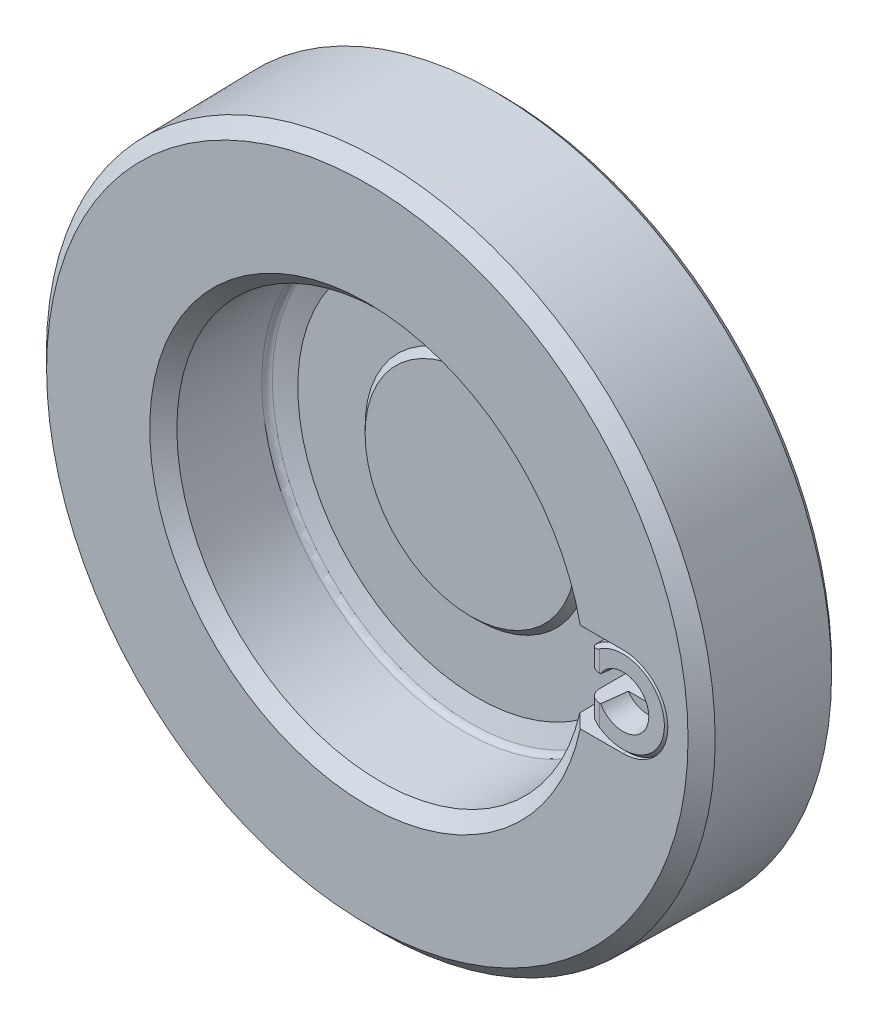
ISO-10303-21;
HEADER;
FILE_DESCRIPTION(('STEP AP214'),'2;1');
FILE_NAME('part.step','',(''),(''),'','','');
FILE_SCHEMA(('AUTOMOTIVE_DESIGN { 1 0 10303 214 1 1 1 1 }'));
ENDSEC;
DATA;
#1=APPLICATION_CONTEXT('core data for automotive mechanical design processes');
#2=APPLICATION_PROTOCOL_DEFINITION('international standard','automotive_design',2000,#1);
#3=PRODUCT_CONTEXT('',#1,'mechanical');
#4=PRODUCT('Part','Part','',(#3));
#5=PRODUCT_RELATED_PRODUCT_CATEGORY('part','',(#4));
#6=PRODUCT_DEFINITION_FORMATION('','',#4);
#7=PRODUCT_DEFINITION_CONTEXT('part definition',#1,'design');
#8=PRODUCT_DEFINITION('design','',#6,#7);
#9=PRODUCT_DEFINITION_SHAPE('','',#8);
#10=(LENGTH_UNIT() NAMED_UNIT(*) SI_UNIT(.MILLI.,.METRE.));
#11=(NAMED_UNIT(*) PLANE_ANGLE_UNIT() SI_UNIT($,.RADIAN.));
#12=(NAMED_UNIT(*) SI_UNIT($,.STERADIAN.) SOLID_ANGLE_UNIT());
#13=UNCERTAINTY_MEASURE_WITH_UNIT(LENGTH_MEASURE(1.E-05),#10,'distance_accuracy_value','');
#14=(GEOMETRIC_REPRESENTATION_CONTEXT(3) GLOBAL_UNCERTAINTY_ASSIGNED_CONTEXT((#13)) GLOBAL_UNIT_ASSIGNED_CONTEXT((#10,
#11,#12)) REPRESENTATION_CONTEXT('',''));
#15=CARTESIAN_POINT('',(0.,0.,0.));
#16=DIRECTION('',(0.,0.,1.));
#17=DIRECTION('',(1.,0.,0.));
#18=AXIS2_PLACEMENT_3D('',#15,#16,#17);
#19=CARTESIAN_POINT('',(-15.25,0.,0.));
#20=DIRECTION('',(0.,0.,1.));
#21=DIRECTION('',(0.,1.,0.));
#22=AXIS2_PLACEMENT_3D('',#19,#20,#21);
#23=PLANE('',#22);
#24=CARTESIAN_POINT('',(0.,0.,0.));
#25=DIRECTION('',(0.,0.,1.));
#26=DIRECTION('',(1.,0.,0.));
#27=AXIS2_PLACEMENT_3D('',#24,#25,#26);
#28=CIRCLE('',#27,15.25);
#29=CARTESIAN_POINT('',(15.25,0.,0.));
#30=VERTEX_POINT('',#29);
#31=EDGE_CURVE('E269',#30,#30,#28,.T.);
#32=ORIENTED_EDGE('',*,*,#31,.F.);
#33=EDGE_LOOP('',(#32));
#34=FACE_BOUND('',#33,.T.);
#35=ADVANCED_FACE('F14',(#34),#23,.F.);
#36=CARTESIAN_POINT('',(0.,0.,0.75));
#37=DIRECTION('',(0.,0.,1.));
#38=DIRECTION('',(1.,0.,0.));
#39=AXIS2_PLACEMENT_3D('',#36,#37,#38);
#40=CONICAL_SURFACE('',#39,16.,0.785398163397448);
#41=CARTESIAN_POINT('',(0.,0.,0.75));
#42=DIRECTION('',(0.,0.,1.));
#43=DIRECTION('',(0.,1.,0.));
#44=AXIS2_PLACEMENT_3D('',#41,#42,#43);
#45=CIRCLE('',#44,16.);
#46=CARTESIAN_POINT('',(0.,16.,0.75));
#47=VERTEX_POINT('',#46);
#48=EDGE_CURVE('E276',#47,#47,#45,.T.);
#49=ORIENTED_EDGE('',*,*,#48,.F.);
#50=EDGE_LOOP('',(#49));
#51=FACE_BOUND('',#50,.T.);
#52=ORIENTED_EDGE('',*,*,#31,.T.);
#53=EDGE_LOOP('',(#52));
#54=FACE_BOUND('',#53,.T.);
#55=ADVANCED_FACE('F231',(#51,#54),#40,.T.);
#56=CARTESIAN_POINT('',(0.,0.,0.));
#57=DIRECTION('',(0.,0.,1.));
#58=DIRECTION('',(0.,1.,0.));
#59=AXIS2_PLACEMENT_3D('',#56,#57,#58);
#60=CYLINDRICAL_SURFACE('',#59,16.);
#61=CARTESIAN_POINT('',(0.,0.,15.));
#62=DIRECTION('',(0.,0.,1.));
#63=DIRECTION('',(0.,1.,0.));
#64=AXIS2_PLACEMENT_3D('',#61,#62,#63);
#65=CIRCLE('',#64,16.);
#66=CARTESIAN_POINT('',(0.,16.,15.));
#67=VERTEX_POINT('',#66);
#68=EDGE_CURVE('E277',#67,#67,#65,.F.);
#69=ORIENTED_EDGE('',*,*,#68,.T.);
#70=EDGE_LOOP('',(#69));
#71=FACE_BOUND('',#70,.T.);
#72=ORIENTED_EDGE('',*,*,#48,.T.);
#73=EDGE_LOOP('',(#72));
#74=FACE_BOUND('',#73,.T.);
#75=ADVANCED_FACE('F228',(#71,#74),#60,.T.);
#76=CARTESIAN_POINT('',(-24.,0.,15.));
#77=DIRECTION('',(0.,0.,1.));
#78=DIRECTION('',(0.,1.,0.));
#79=AXIS2_PLACEMENT_3D('',#76,#77,#78);
#80=PLANE('',#79);
#81=CARTESIAN_POINT('',(0.,0.,15.));
#82=DIRECTION('',(0.,0.,1.));
#83=DIRECTION('',(0.,1.,0.));
#84=AXIS2_PLACEMENT_3D('',#81,#82,#83);
#85=CIRCLE('',#84,24.);
#86=CARTESIAN_POINT('',(0.,24.,15.));
#87=VERTEX_POINT('',#86);
#88=EDGE_CURVE('E189',#87,#87,#85,.T.);
#89=ORIENTED_EDGE('',*,*,#88,.F.);
#90=EDGE_LOOP('',(#89));
#91=FACE_BOUND('',#90,.T.);
#92=ORIENTED_EDGE('',*,*,#68,.F.);
#93=EDGE_LOOP('',(#92));
#94=FACE_BOUND('',#93,.T.);
#95=ADVANCED_FACE('F226',(#91,#94),#80,.F.);
#96=CARTESIAN_POINT('',(0.,0.,0.));
#97=DIRECTION('',(0.,0.,1.));
#98=DIRECTION('',(0.,1.,0.));
#99=AXIS2_PLACEMENT_3D('',#96,#97,#98);
#100=CYLINDRICAL_SURFACE('',#99,24.);
#101=CARTESIAN_POINT('',(0.,0.,23.6076951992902));
#102=DIRECTION('',(0.,0.,-1.));
#103=DIRECTION('',(0.,-1.,0.));
#104=AXIS2_PLACEMENT_3D('',#101,#102,#103);
#105=CIRCLE('',#104,24.);
#106=CARTESIAN_POINT('',(0.,-24.,23.6076951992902));
#107=VERTEX_POINT('',#106);
#108=EDGE_CURVE('E320',#107,#107,#105,.T.);
#109=ORIENTED_EDGE('',*,*,#108,.T.);
#110=EDGE_LOOP('',(#109));
#111=FACE_BOUND('',#110,.T.);
#112=ORIENTED_EDGE('',*,*,#88,.T.);
#113=EDGE_LOOP('',(#112));
#114=FACE_BOUND('',#113,.T.);
#115=ADVANCED_FACE('F633',(#111,#114),#100,.T.);
#116=CARTESIAN_POINT('',(0.,0.,23.6076951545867));
#117=DIRECTION('',(0.,0.,-1.));
#118=DIRECTION('',(0.,-1.,0.));
#119=AXIS2_PLACEMENT_3D('',#116,#117,#118);
#120=TOROIDAL_SURFACE('',#119,27.,3.);
#121=CARTESIAN_POINT('',(0.,0.,26.20577136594));
#122=DIRECTION('',(0.,0.,1.));
#123=DIRECTION('',(0.,1.,0.));
#124=AXIS2_PLACEMENT_3D('',#121,#122,#123);
#125=CIRCLE('',#124,25.5);
#126=CARTESIAN_POINT('',(0.,25.5,26.20577136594));
#127=VERTEX_POINT('',#126);
#128=EDGE_CURVE('E665',#127,#127,#125,.T.);
#129=ORIENTED_EDGE('',*,*,#128,.F.);
#130=EDGE_LOOP('',(#129));
#131=FACE_BOUND('',#130,.T.);
#132=ORIENTED_EDGE('',*,*,#108,.F.);
#133=EDGE_LOOP('',(#132));
#134=FACE_BOUND('',#133,.T.);
#135=ADVANCED_FACE('F626',(#131,#134),#120,.F.);
#136=CARTESIAN_POINT('',(0.,0.,32.7009618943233));
#137=DIRECTION('',(0.,0.,1.));
#138=DIRECTION('',(0.,1.,0.));
#139=AXIS2_PLACEMENT_3D('',#136,#137,#138);
#140=CONICAL_SURFACE('',#139,36.75,1.0471975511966);
#141=CARTESIAN_POINT('',(0.,0.,32.7009618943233));
#142=DIRECTION('',(0.,0.,-1.));
#143=DIRECTION('',(0.,-1.,0.));
#144=AXIS2_PLACEMENT_3D('',#141,#142,#143);
#145=CIRCLE('',#144,36.75);
#146=CARTESIAN_POINT('',(0.,-36.75,32.7009618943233));
#147=VERTEX_POINT('',#146);
#148=EDGE_CURVE('E608',#147,#147,#145,.T.);
#149=ORIENTED_EDGE('',*,*,#148,.T.);
#150=EDGE_LOOP('',(#149));
#151=FACE_BOUND('',#150,.T.);
#152=ORIENTED_EDGE('',*,*,#128,.T.);
#153=EDGE_LOOP('',(#152));
#154=FACE_BOUND('',#153,.T.);
#155=ADVANCED_FACE('F619',(#151,#154),#140,.T.);
#156=CARTESIAN_POINT('',(0.,0.,31.4019237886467));
#157=DIRECTION('',(0.,0.,-1.));
#158=DIRECTION('',(0.,-1.,0.));
#159=AXIS2_PLACEMENT_3D('',#156,#157,#158);
#160=TOROIDAL_SURFACE('',#159,37.5,1.5);
#161=CARTESIAN_POINT('',(0.,0.,31.4019237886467));
#162=DIRECTION('',(0.,0.,1.));
#163=DIRECTION('',(0.,1.,0.));
#164=AXIS2_PLACEMENT_3D('',#161,#162,#163);
#165=CIRCLE('',#164,39.);
#166=CARTESIAN_POINT('',(0.,39.,31.4019237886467));
#167=VERTEX_POINT('',#166);
#168=EDGE_CURVE('E598',#167,#167,#165,.F.);
#169=ORIENTED_EDGE('',*,*,#168,.T.);
#170=EDGE_LOOP('',(#169));
#171=FACE_BOUND('',#170,.T.);
#172=ORIENTED_EDGE('',*,*,#148,.F.);
#173=EDGE_LOOP('',(#172));
#174=FACE_BOUND('',#173,.T.);
#175=ADVANCED_FACE('F615',(#171,#174),#160,.F.);
#176=CARTESIAN_POINT('',(0.,0.,38.));
#177=DIRECTION('',(0.,0.,-1.));
#178=DIRECTION('',(0.,-1.,0.));
#179=AXIS2_PLACEMENT_3D('',#176,#177,#178);
#180=PLANE('',#179);
#181=CARTESIAN_POINT('',(0.,0.,38.));
#182=DIRECTION('',(0.,0.,-1.));
#183=DIRECTION('',(0.,-1.,0.));
#184=AXIS2_PLACEMENT_3D('',#181,#182,#183);
#185=CIRCLE('',#184,23.5);
#186=CARTESIAN_POINT('',(0.,-23.5,38.));
#187=VERTEX_POINT('',#186);
#188=EDGE_CURVE('E18',#187,#187,#185,.T.);
#189=ORIENTED_EDGE('',*,*,#188,.F.);
#190=EDGE_LOOP('',(#189));
#191=FACE_BOUND('',#190,.T.);
#192=ADVANCED_FACE('F16',(#191),#180,.F.);
#193=CARTESIAN_POINT('',(0.,0.,0.));
#194=DIRECTION('',(0.,0.,1.));
#195=DIRECTION('',(0.,1.,0.));
#196=AXIS2_PLACEMENT_3D('',#193,#194,#195);
#197=CYLINDRICAL_SURFACE('',#196,39.);
#198=CARTESIAN_POINT('',(0.,0.,31.));
#199=DIRECTION('',(0.,0.,1.));
#200=DIRECTION('',(0.,1.,0.));
#201=AXIS2_PLACEMENT_3D('',#198,#199,#200);
#202=CIRCLE('',#201,39.);
#203=CARTESIAN_POINT('',(0.,39.,31.));
#204=VERTEX_POINT('',#203);
#205=EDGE_CURVE('E597',#204,#204,#202,.F.);
#206=ORIENTED_EDGE('',*,*,#205,.T.);
#207=EDGE_LOOP('',(#206));
#208=FACE_BOUND('',#207,.T.);
#209=ORIENTED_EDGE('',*,*,#168,.F.);
#210=EDGE_LOOP('',(#209));
#211=FACE_BOUND('',#210,.T.);
#212=ADVANCED_FACE('F252',(#208,#211),#197,.F.);
#213=CARTESIAN_POINT('',(0.,0.,36.5));
#214=DIRECTION('',(0.,0.,-1.));
#215=DIRECTION('',(0.,-1.,0.));
#216=AXIS2_PLACEMENT_3D('',#213,#214,#215);
#217=CONICAL_SURFACE('',#216,25.,0.785398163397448);
#218=ORIENTED_EDGE('',*,*,#188,.T.);
#219=EDGE_LOOP('',(#218));
#220=FACE_BOUND('',#219,.T.);
#221=CARTESIAN_POINT('',(0.,0.,36.5));
#222=DIRECTION('',(0.,0.,-1.));
#223=DIRECTION('',(0.,-1.,0.));
#224=AXIS2_PLACEMENT_3D('',#221,#222,#223);
#225=CIRCLE('',#224,25.);
#226=CARTESIAN_POINT('',(0.,-25.,36.5));
#227=VERTEX_POINT('',#226);
#228=EDGE_CURVE('E268',#227,#227,#225,.F.);
#229=ORIENTED_EDGE('',*,*,#228,.T.);
#230=EDGE_LOOP('',(#229));
#231=FACE_BOUND('',#230,.T.);
#232=ADVANCED_FACE('F250',(#220,#231),#217,.T.);
#233=CARTESIAN_POINT('',(-73.5261825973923,0.,31.));
#234=DIRECTION('',(0.,0.,1.));
#235=DIRECTION('',(0.,1.,0.));
#236=AXIS2_PLACEMENT_3D('',#233,#234,#235);
#237=PLANE('',#236);
#238=CARTESIAN_POINT('',(0.,0.,31.));
#239=DIRECTION('',(0.,0.,1.));
#240=DIRECTION('',(0.,1.,0.));
#241=AXIS2_PLACEMENT_3D('',#238,#239,#240);
#242=CIRCLE('',#241,73.5261825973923);
#243=CARTESIAN_POINT('',(0.,73.5261825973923,31.));
#244=VERTEX_POINT('',#243);
#245=EDGE_CURVE('E451',#244,#244,#242,.T.);
#246=ORIENTED_EDGE('',*,*,#245,.F.);
#247=EDGE_LOOP('',(#246));
#248=FACE_BOUND('',#247,.T.);
#249=ORIENTED_EDGE('',*,*,#205,.F.);
#250=EDGE_LOOP('',(#249));
#251=FACE_BOUND('',#250,.T.);
#252=ADVANCED_FACE('F246',(#248,#251),#237,.F.);
#253=CARTESIAN_POINT('',(-25.,0.,36.5));
#254=DIRECTION('',(0.,0.,-1.));
#255=DIRECTION('',(0.,-1.,0.));
#256=AXIS2_PLACEMENT_3D('',#253,#254,#255);
#257=PLANE('',#256);
#258=ORIENTED_EDGE('',*,*,#228,.F.);
#259=EDGE_LOOP('',(#258));
#260=FACE_BOUND('',#259,.T.);
#261=CARTESIAN_POINT('',(0.,0.,36.5));
#262=DIRECTION('',(0.,0.,1.));
#263=DIRECTION('',(1.,0.,0.));
#264=AXIS2_PLACEMENT_3D('',#261,#262,#263);
#265=CIRCLE('',#264,40.);
#266=CARTESIAN_POINT('',(40.,0.,36.5));
#267=VERTEX_POINT('',#266);
#268=EDGE_CURVE('E271',#267,#267,#265,.T.);
#269=ORIENTED_EDGE('',*,*,#268,.T.);
#270=EDGE_LOOP('',(#269));
#271=FACE_BOUND('',#270,.T.);
#272=ADVANCED_FACE('F242',(#260,#271),#257,.F.);
#273=CARTESIAN_POINT('',(0.,0.,32.4997715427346));
#274=DIRECTION('',(0.,0.,1.));
#275=DIRECTION('',(0.,1.,0.));
#276=AXIS2_PLACEMENT_3D('',#273,#274,#275);
#277=CONICAL_SURFACE('',#276,75.0000039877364,0.776671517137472);
#278=CARTESIAN_POINT('',(0.,0.,32.4997715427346));
#279=DIRECTION('',(0.,0.,1.));
#280=DIRECTION('',(0.,1.,0.));
#281=AXIS2_PLACEMENT_3D('',#278,#279,#280);
#282=CIRCLE('',#281,75.0000039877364);
#283=CARTESIAN_POINT('',(0.,75.0000039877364,32.4997715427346));
#284=VERTEX_POINT('',#283);
#285=EDGE_CURVE('E594',#284,#284,#282,.F.);
#286=ORIENTED_EDGE('',*,*,#285,.T.);
#287=EDGE_LOOP('',(#286));
#288=FACE_BOUND('',#287,.T.);
#289=ORIENTED_EDGE('',*,*,#245,.T.);
#290=EDGE_LOOP('',(#289));
#291=FACE_BOUND('',#290,.T.);
#292=ADVANCED_FACE('F245',(#288,#291),#277,.T.);
#293=CARTESIAN_POINT('',(57.,0.,41.5));
#294=DIRECTION('',(0.,0.,1.));
#295=DIRECTION('',(0.,1.,0.));
#296=AXIS2_PLACEMENT_3D('',#293,#294,#295);
#297=PLANE('',#296);
#298=CARTESIAN_POINT('',(63.,0.,41.5));
#299=DIRECTION('',(0.,0.,-1.));
#300=DIRECTION('',(0.,-1.,0.));
#301=AXIS2_PLACEMENT_3D('',#298,#299,#300);
#302=CIRCLE('',#301,2.99999999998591);
#303=CARTESIAN_POINT('',(63.,-2.99999999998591,41.5));
#304=VERTEX_POINT('',#303);
#305=EDGE_CURVE('E347',#304,#304,#302,.T.);
#306=ORIENTED_EDGE('',*,*,#305,.F.);
#307=EDGE_LOOP('',(#306));
#308=FACE_BOUND('',#307,.T.);
#309=ADVANCED_FACE('F237',(#308),#297,.T.);
#310=CARTESIAN_POINT('',(0.,0.,38.0109317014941));
#311=DIRECTION('',(0.,0.,1.));
#312=DIRECTION('',(1.,0.,0.));
#313=AXIS2_PLACEMENT_3D('',#310,#311,#312);
#314=CONICAL_SURFACE('',#313,44.1512507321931,1.22173047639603);
#315=ORIENTED_EDGE('',*,*,#268,.F.);
#316=EDGE_LOOP('',(#315));
#317=FACE_BOUND('',#316,.T.);
#318=CARTESIAN_POINT('',(0.,0.,38.0109317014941));
#319=DIRECTION('',(0.,0.,-1.));
#320=DIRECTION('',(0.,-1.,0.));
#321=AXIS2_PLACEMENT_3D('',#318,#319,#320);
#322=CIRCLE('',#321,44.1512507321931);
#323=CARTESIAN_POINT('',(0.,-44.1512507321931,38.0109317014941));
#324=VERTEX_POINT('',#323);
#325=EDGE_CURVE('E216',#324,#324,#322,.F.);
#326=ORIENTED_EDGE('',*,*,#325,.T.);
#327=EDGE_LOOP('',(#326));
#328=FACE_BOUND('',#327,.T.);
#329=ADVANCED_FACE('F233',(#317,#328),#314,.F.);
#330=CARTESIAN_POINT('',(0.,0.,32.4997715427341));
#331=DIRECTION('',(0.,0.,-1.));
#332=DIRECTION('',(0.,-1.,0.));
#333=AXIS2_PLACEMENT_3D('',#330,#331,#332);
#334=CONICAL_SURFACE('',#333,75.0000039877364,0.0174532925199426);
#335=CARTESIAN_POINT('',(0.,0.,58.0004569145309));
#336=DIRECTION('',(0.,0.,-1.));
#337=DIRECTION('',(0.,-1.,0.));
#338=AXIS2_PLACEMENT_3D('',#335,#336,#337);
#339=CIRCLE('',#338,74.5548878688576);
#340=CARTESIAN_POINT('',(0.,-74.5548878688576,58.0004569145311));
#341=VERTEX_POINT('',#340);
#342=EDGE_CURVE('E603',#341,#341,#339,.T.);
#343=ORIENTED_EDGE('',*,*,#342,.T.);
#344=EDGE_LOOP('',(#343));
#345=FACE_BOUND('',#344,.T.);
#346=ORIENTED_EDGE('',*,*,#285,.F.);
#347=EDGE_LOOP('',(#346));
#348=FACE_BOUND('',#347,.T.);
#349=ADVANCED_FACE('F236',(#345,#348),#334,.T.);
#350=CARTESIAN_POINT('',(63.,0.,41.5000000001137));
#351=DIRECTION('',(0.,0.,-1.));
#352=DIRECTION('',(0.,-1.,0.));
#353=AXIS2_PLACEMENT_3D('',#350,#351,#352);
#354=CONICAL_SURFACE('',#353,2.99999999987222,0.785398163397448);
#355=CARTESIAN_POINT('',(63.,0.,42.0414999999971));
#356=DIRECTION('',(0.,0.,-1.));
#357=DIRECTION('',(0.,-1.,0.));
#358=AXIS2_PLACEMENT_3D('',#355,#356,#357);
#359=CIRCLE('',#358,2.45849999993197);
#360=CARTESIAN_POINT('',(63.,-2.45849999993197,42.0414999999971));
#361=VERTEX_POINT('',#360);
#362=EDGE_CURVE('E498',#361,#361,#359,.T.);
#363=ORIENTED_EDGE('',*,*,#362,.F.);
#364=EDGE_LOOP('',(#363));
#365=FACE_BOUND('',#364,.T.);
#366=ORIENTED_EDGE('',*,*,#305,.T.);
#367=EDGE_LOOP('',(#366));
#368=FACE_BOUND('',#367,.T.);
#369=ADVANCED_FACE('F796',(#365,#368),#354,.F.);
#370=CARTESIAN_POINT('',(63.,0.,48.0999999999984));
#371=DIRECTION('',(0.,0.,-1.));
#372=DIRECTION('',(0.,-1.,0.));
#373=AXIS2_PLACEMENT_3D('',#370,#371,#372);
#374=CONICAL_SURFACE('',#373,2.45849999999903,1.0471975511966);
#375=CARTESIAN_POINT('',(63.,0.,49.5194156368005));
#376=VERTEX_POINT('',#375);
#377=VERTEX_LOOP('',#376);
#378=FACE_BOUND('',#377,.T.);
#379=CARTESIAN_POINT('',(63.,0.,48.1));
#380=DIRECTION('',(0.,0.,1.));
#381=DIRECTION('',(0.,1.,0.));
#382=AXIS2_PLACEMENT_3D('',#379,#380,#381);
#383=CIRCLE('',#382,2.4585);
#384=CARTESIAN_POINT('',(61.2992093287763,1.77525585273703,48.0999999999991));
#385=VERTEX_POINT('',#384);
#386=CARTESIAN_POINT('',(61.2992093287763,-1.77525585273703,48.0999999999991));
#387=VERTEX_POINT('',#386);
#388=EDGE_CURVE('E444',#385,#387,#383,.F.);
#389=ORIENTED_EDGE('',*,*,#388,.T.);
#390=CARTESIAN_POINT('',(61.2992093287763,1.77525585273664,48.0999999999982));
#391=CARTESIAN_POINT('',(61.2992093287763,1.71656796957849,48.1244583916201));
#392=CARTESIAN_POINT('',(61.2992093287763,1.6576756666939,48.1484378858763));
#393=CARTESIAN_POINT('',(61.2992093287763,1.53940045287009,48.1952093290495));
#394=CARTESIAN_POINT('',(61.2992093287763,1.48001739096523,48.2180008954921));
#395=CARTESIAN_POINT('',(61.2992093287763,1.36035355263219,48.262285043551));
#396=CARTESIAN_POINT('',(61.2992093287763,1.30006951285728,48.2837688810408));
#397=CARTESIAN_POINT('',(61.2992093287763,1.17890751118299,48.3249675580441));
#398=CARTESIAN_POINT('',(61.2992093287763,1.11802959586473,48.3446825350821));
#399=CARTESIAN_POINT('',(61.2992093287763,0.936341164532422,48.4000528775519));
#400=CARTESIAN_POINT('',(61.2992093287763,0.814565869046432,48.4326628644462));
#401=CARTESIAN_POINT('',(61.2992093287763,0.568645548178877,48.4861032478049));
#402=CARTESIAN_POINT('',(61.2992093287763,0.44450702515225,48.5069621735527));
#403=CARTESIAN_POINT('',(61.2992093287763,0.218111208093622,48.5310957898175));
#404=CARTESIAN_POINT('',(61.2992093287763,0.116135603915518,48.5369421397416));
#405=CARTESIAN_POINT('',(61.2992093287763,-0.0879004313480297,48.5379175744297));
#406=CARTESIAN_POINT('',(61.2992093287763,-0.18996087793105,48.5330437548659));
#407=CARTESIAN_POINT('',(61.2992093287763,-0.39323617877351,48.5132285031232));
#408=CARTESIAN_POINT('',(61.2992093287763,-0.494449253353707,48.498269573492));
#409=CARTESIAN_POINT('',(61.2992093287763,-0.695268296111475,48.4600022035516));
#410=CARTESIAN_POINT('',(61.2992093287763,-0.794873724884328,48.436691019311));
#411=CARTESIAN_POINT('',(61.2992093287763,-0.969073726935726,48.3899133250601));
#412=CARTESIAN_POINT('',(61.2992093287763,-1.04403542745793,48.3677756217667));
#413=CARTESIAN_POINT('',(61.2992093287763,-1.19299138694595,48.3205206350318));
#414=CARTESIAN_POINT('',(61.2992093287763,-1.26698584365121,48.2954039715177));
#415=CARTESIAN_POINT('',(61.2992093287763,-1.41378203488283,48.2429425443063));
#416=CARTESIAN_POINT('',(61.2992093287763,-1.48658772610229,48.2156087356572));
#417=CARTESIAN_POINT('',(61.2992093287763,-1.63144923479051,48.1590835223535));
#418=CARTESIAN_POINT('',(61.2992093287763,-1.70350528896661,48.1298927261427));
#419=CARTESIAN_POINT('',(61.2992093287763,-1.77525585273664,48.0999999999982));
#420=B_SPLINE_CURVE_WITH_KNOTS('',3,(#390,#391,#392,#393,#394,#395,#396,#397,#398,#399,#400,
#401,#402,#403,#404,#405,#406,#407,#408,#409,#410,#411,#412,#413,#414,#415,#416,#417,#418,#419),
.UNSPECIFIED.,.F.,.F.,(4,2,2,2,2,2,2,2,2,2,2,2,2,2,4),(0.,0.190745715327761,0.381552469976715,
0.573519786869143,0.765472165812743,1.14325403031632,1.52011471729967,1.82600709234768,
2.13198235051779,2.43848984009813,2.74509811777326,2.97951712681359,3.21388743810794,
3.44716304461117,3.68036260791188),.UNSPECIFIED.);
#421=EDGE_CURVE('E450',#385,#387,#420,.T.);
#422=ORIENTED_EDGE('',*,*,#421,.F.);
#423=EDGE_LOOP('',(#389,#422));
#424=FACE_BOUND('',#423,.T.);
#425=ADVANCED_FACE('F224',(#378,#424),#374,.F.);
#426=CARTESIAN_POINT('',(0.,0.,39.4204706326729));
#427=DIRECTION('',(0.,0.,-1.));
#428=DIRECTION('',(0.,-1.,0.));
#429=AXIS2_PLACEMENT_3D('',#426,#427,#428);
#430=TOROIDAL_SURFACE('',#429,43.6382205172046,1.5);
#431=ORIENTED_EDGE('',*,*,#325,.F.);
#432=EDGE_LOOP('',(#431));
#433=FACE_BOUND('',#432,.T.);
#434=CARTESIAN_POINT('',(0.,0.,39.394292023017));
#435=DIRECTION('',(0.,0.,1.));
#436=DIRECTION('',(0.,1.,0.));
#437=AXIS2_PLACEMENT_3D('',#434,#435,#436);
#438=CIRCLE('',#437,45.1379920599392);
#439=CARTESIAN_POINT('',(0.,45.1379920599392,39.3942920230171));
#440=VERTEX_POINT('',#439);
#441=EDGE_CURVE('E199',#440,#440,#438,.T.);
#442=ORIENTED_EDGE('',*,*,#441,.T.);
#443=EDGE_LOOP('',(#442));
#444=FACE_BOUND('',#443,.T.);
#445=ADVANCED_FACE('F219',(#433,#444),#430,.F.);
#446=CARTESIAN_POINT('',(0.,0.,58.0004569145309));
#447=DIRECTION('',(0.,0.,-1.));
#448=DIRECTION('',(-1.,0.,0.));
#449=AXIS2_PLACEMENT_3D('',#446,#447,#448);
#450=CONICAL_SURFACE('',#449,74.5548878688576,0.794124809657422);
#451=CARTESIAN_POINT('',(0.,0.,61.));
#452=DIRECTION('',(0.,0.,-1.));
#453=DIRECTION('',(-1.,0.,0.));
#454=AXIS2_PLACEMENT_3D('',#451,#452,#453);
#455=CIRCLE('',#454,71.5025306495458);
#456=CARTESIAN_POINT('',(-71.5025306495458,0.,61.));
#457=VERTEX_POINT('',#456);
#458=EDGE_CURVE('E667',#457,#457,#455,.T.);
#459=ORIENTED_EDGE('',*,*,#458,.T.);
#460=EDGE_LOOP('',(#459));
#461=FACE_BOUND('',#460,.T.);
#462=ORIENTED_EDGE('',*,*,#342,.F.);
#463=EDGE_LOOP('',(#462));
#464=FACE_BOUND('',#463,.T.);
#465=ADVANCED_FACE('F223',(#461,#464),#450,.T.);
#466=CARTESIAN_POINT('',(57.,0.,60.2200000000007));
#467=DIRECTION('',(0.,0.,-1.));
#468=DIRECTION('',(0.,-1.,0.));
#469=AXIS2_PLACEMENT_3D('',#466,#467,#468);
#470=CONICAL_SURFACE('',#469,9.99999999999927,0.785398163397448);
#471=CARTESIAN_POINT('',(57.,0.,60.2200000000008));
#472=DIRECTION('',(0.,0.,-1.));
#473=DIRECTION('',(0.,-1.,0.));
#474=AXIS2_PLACEMENT_3D('',#471,#472,#473);
#475=CIRCLE('',#474,10.);
#476=CARTESIAN_POINT('',(49.8610312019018,7.0025084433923,60.22));
#477=VERTEX_POINT('',#476);
#478=CARTESIAN_POINT('',(57.,10.,60.2200000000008));
#479=VERTEX_POINT('',#478);
#480=EDGE_CURVE('E528',#477,#479,#475,.T.);
#481=ORIENTED_EDGE('',*,*,#480,.F.);
#482=CARTESIAN_POINT('',(49.8610312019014,7.00250844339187,60.22));
#483=CARTESIAN_POINT('',(49.8960826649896,6.99016189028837,60.2536653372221));
#484=CARTESIAN_POINT('',(49.932414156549,6.97988335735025,60.2867660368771));
#485=CARTESIAN_POINT('',(50.0072953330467,6.96356749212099,60.3514261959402));
#486=CARTESIAN_POINT('',(50.045843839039,6.95752792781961,60.3829864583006));
#487=CARTESIAN_POINT('',(50.1243448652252,6.9498319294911,60.4437950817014));
#488=CARTESIAN_POINT('',(50.1642728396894,6.94811992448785,60.4730680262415));
#489=CARTESIAN_POINT('',(50.2455854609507,6.94880413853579,60.5294308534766));
#490=CARTESIAN_POINT('',(50.2869700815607,6.95120028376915,60.5565207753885));
#491=CARTESIAN_POINT('',(50.4125795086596,6.96421802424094,60.6340691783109));
#492=CARTESIAN_POINT('',(50.4984687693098,6.98065079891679,60.6809676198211));
#493=CARTESIAN_POINT('',(50.6719639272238,7.02623082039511,60.7645455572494));
#494=CARTESIAN_POINT('',(50.7595748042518,7.05542263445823,60.8011884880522));
#495=CARTESIAN_POINT('',(50.9710262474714,7.13759694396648,60.877717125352));
#496=CARTESIAN_POINT('',(51.0947664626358,7.19542440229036,60.9126028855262));
#497=CARTESIAN_POINT('',(51.3392826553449,7.32364862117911,60.9646736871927));
#498=CARTESIAN_POINT('',(51.4600548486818,7.39406056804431,60.9818371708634));
#499=CARTESIAN_POINT('',(51.6160757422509,7.49203863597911,60.994203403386));
#500=CARTESIAN_POINT('',(51.6532437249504,7.51591847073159,60.9963958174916));
#501=CARTESIAN_POINT('',(51.7270109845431,7.56432341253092,60.9992910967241));
#502=CARTESIAN_POINT('',(51.7636119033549,7.58884567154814,60.9999996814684));
#503=CARTESIAN_POINT('',(51.8,7.6136981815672,61.));
#504=B_SPLINE_CURVE_WITH_KNOTS('',3,(#482,#483,#484,#485,#486,#487,#488,#489,#490,#491,#492,
#493,#494,#495,#496,#497,#498,#499,#500,#501,#502,#503),.UNSPECIFIED.,.F.,.F.,(4,2,2,2,2,2,2,2,
2,2,4),(0.,0.150380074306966,0.300680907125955,0.449041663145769,0.597399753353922,
0.893335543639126,1.19031340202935,1.61091753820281,2.03203270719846,2.16471044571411,
2.29687581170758),.UNSPECIFIED.);
#505=CARTESIAN_POINT('',(51.8,7.61369818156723,61.));
#506=VERTEX_POINT('',#505);
#507=EDGE_CURVE('E374',#477,#506,#504,.T.);
#508=ORIENTED_EDGE('',*,*,#507,.T.);
#509=CARTESIAN_POINT('',(57.,0.,61.));
#510=DIRECTION('',(0.,0.,-1.));
#511=DIRECTION('',(0.,-1.,0.));
#512=AXIS2_PLACEMENT_3D('',#509,#510,#511);
#513=CIRCLE('',#512,9.22);
#514=CARTESIAN_POINT('',(51.8,-7.61369818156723,61.));
#515=VERTEX_POINT('',#514);
#516=EDGE_CURVE('E523',#506,#515,#513,.T.);
#517=ORIENTED_EDGE('',*,*,#516,.T.);
#518=CARTESIAN_POINT('',(49.8610312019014,-7.00250844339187,60.22));
#519=CARTESIAN_POINT('',(49.8960826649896,-6.99016189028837,60.2536653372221));
#520=CARTESIAN_POINT('',(49.932414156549,-6.97988335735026,60.2867660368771));
#521=CARTESIAN_POINT('',(50.0072953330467,-6.96356749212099,60.3514261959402));
#522=CARTESIAN_POINT('',(50.045843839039,-6.95752792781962,60.3829864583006));
#523=CARTESIAN_POINT('',(50.1243448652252,-6.9498319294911,60.4437950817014));
#524=CARTESIAN_POINT('',(50.1642728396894,-6.94811992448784,60.4730680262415));
#525=CARTESIAN_POINT('',(50.2455854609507,-6.94880413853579,60.5294308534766));
#526=CARTESIAN_POINT('',(50.2869700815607,-6.95120028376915,60.5565207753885));
#527=CARTESIAN_POINT('',(50.4125795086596,-6.96421802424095,60.6340691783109));
#528=CARTESIAN_POINT('',(50.4984687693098,-6.98065079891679,60.6809676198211));
#529=CARTESIAN_POINT('',(50.6719639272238,-7.02623082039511,60.7645455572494));
#530=CARTESIAN_POINT('',(50.7595748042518,-7.05542263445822,60.8011884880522));
#531=CARTESIAN_POINT('',(50.9710262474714,-7.13759694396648,60.877717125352));
#532=CARTESIAN_POINT('',(51.0947664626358,-7.19542440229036,60.9126028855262));
#533=CARTESIAN_POINT('',(51.3392826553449,-7.32364862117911,60.9646736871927));
#534=CARTESIAN_POINT('',(51.4600548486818,-7.39406056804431,60.9818371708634));
#535=CARTESIAN_POINT('',(51.6160757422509,-7.49203863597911,60.994203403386));
#536=CARTESIAN_POINT('',(51.6532437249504,-7.51591847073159,60.9963958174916));
#537=CARTESIAN_POINT('',(51.7270109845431,-7.56432341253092,60.9992910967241));
#538=CARTESIAN_POINT('',(51.7636119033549,-7.58884567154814,60.9999996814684));
#539=CARTESIAN_POINT('',(51.8,-7.6136981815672,61.));
#540=B_SPLINE_CURVE_WITH_KNOTS('',3,(#518,#519,#520,#521,#522,#523,#524,#525,#526,#527,#528,
#529,#530,#531,#532,#533,#534,#535,#536,#537,#538,#539),.UNSPECIFIED.,.F.,.F.,(4,2,2,2,2,2,2,2,
2,2,4),(0.,0.150380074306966,0.300680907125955,0.449041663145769,0.597399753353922,
0.893335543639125,1.19031340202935,1.61091753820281,2.03203270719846,2.16471044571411,
2.29687581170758),.UNSPECIFIED.);
#541=CARTESIAN_POINT('',(49.8610312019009,-7.00250844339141,60.22));
#542=VERTEX_POINT('',#541);
#543=EDGE_CURVE('E366',#542,#515,#540,.T.);
#544=ORIENTED_EDGE('',*,*,#543,.F.);
#545=CARTESIAN_POINT('',(57.,-10.,60.2200000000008));
#546=VERTEX_POINT('',#545);
#547=EDGE_CURVE('E405',#546,#542,#475,.T.);
#548=ORIENTED_EDGE('',*,*,#547,.F.);
#549=EDGE_CURVE('E531',#479,#546,#475,.T.);
#550=ORIENTED_EDGE('',*,*,#549,.F.);
#551=EDGE_LOOP('',(#481,#508,#517,#544,#548,#550));
#552=FACE_BOUND('',#551,.T.);
#553=ADVANCED_FACE('F332',(#552),#470,.T.);
#554=DIRECTION('',(-1.,0.,0.));
#555=VECTOR('',#554,1.);
#556=CARTESIAN_POINT('',(0.,-10.,41.5));
#557=LINE('',#556,#555);
#558=CARTESIAN_POINT('',(57.,-10.,41.5));
#559=VERTEX_POINT('',#558);
#560=CARTESIAN_POINT('',(44.0540326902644,-10.,41.5));
#561=VERTEX_POINT('',#560);
#562=EDGE_CURVE('E318',#559,#561,#557,.T.);
#563=ORIENTED_EDGE('',*,*,#562,.F.);
#564=CARTESIAN_POINT('',(57.,0.,41.5));
#565=DIRECTION('',(0.,0.,-1.));
#566=DIRECTION('',(0.,-1.,0.));
#567=AXIS2_PLACEMENT_3D('',#564,#565,#566);
#568=CIRCLE('',#567,10.);
#569=CARTESIAN_POINT('',(49.,-6.,41.5));
#570=VERTEX_POINT('',#569);
#571=EDGE_CURVE('E686',#570,#559,#568,.F.);
#572=ORIENTED_EDGE('',*,*,#571,.F.);
#573=DIRECTION('',(0.,1.,0.));
#574=VECTOR('',#573,1.);
#575=CARTESIAN_POINT('',(49.,0.,41.5));
#576=LINE('',#575,#574);
#577=CARTESIAN_POINT('',(49.,6.,41.5));
#578=VERTEX_POINT('',#577);
#579=EDGE_CURVE('E350',#578,#570,#576,.F.);
#580=ORIENTED_EDGE('',*,*,#579,.F.);
#581=CARTESIAN_POINT('',(57.,10.,41.5));
#582=VERTEX_POINT('',#581);
#583=EDGE_CURVE('E203',#582,#578,#568,.F.);
#584=ORIENTED_EDGE('',*,*,#583,.F.);
#585=DIRECTION('',(1.,0.,0.));
#586=VECTOR('',#585,1.);
#587=CARTESIAN_POINT('',(57.,10.,41.5));
#588=LINE('',#587,#586);
#589=CARTESIAN_POINT('',(44.0540326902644,10.,41.5));
#590=VERTEX_POINT('',#589);
#591=EDGE_CURVE('E184',#590,#582,#588,.T.);
#592=ORIENTED_EDGE('',*,*,#591,.F.);
#593=CARTESIAN_POINT('',(0.,0.,41.5));
#594=DIRECTION('',(0.,0.,1.));
#595=DIRECTION('',(0.,1.,0.));
#596=AXIS2_PLACEMENT_3D('',#593,#594,#595);
#597=CIRCLE('',#596,45.1747473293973);
#598=EDGE_CURVE('E193',#590,#561,#597,.F.);
#599=ORIENTED_EDGE('',*,*,#598,.T.);
#600=EDGE_LOOP('',(#563,#572,#580,#584,#592,#599));
#601=FACE_BOUND('',#600,.T.);
#602=ADVANCED_FACE('F201',(#601),#297,.T.);
#603=CARTESIAN_POINT('',(0.,0.,58.000456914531));
#604=DIRECTION('',(0.,0.,1.));
#605=DIRECTION('',(0.,1.,0.));
#606=AXIS2_PLACEMENT_3D('',#603,#604,#605);
#607=CONICAL_SURFACE('',#606,45.4627638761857,0.0174532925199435);
#608=ORIENTED_EDGE('',*,*,#441,.F.);
#609=EDGE_LOOP('',(#608));
#610=FACE_BOUND('',#609,.T.);
#611=CARTESIAN_POINT('',(44.0540326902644,-10.,41.5));
#612=CARTESIAN_POINT('',(44.1032565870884,-10.,44.2500760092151));
#613=CARTESIAN_POINT('',(44.1524764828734,-10.,47.0001520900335));
#614=CARTESIAN_POINT('',(44.2509082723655,-10.,52.5003043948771));
#615=CARTESIAN_POINT('',(44.3001201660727,-10.,55.2503806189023));
#616=CARTESIAN_POINT('',(44.3493280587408,-10.,58.0004569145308));
#617=B_SPLINE_CURVE_WITH_KNOTS('',3,(#611,#612,#613,#614,#615,#616),.UNSPECIFIED.,.F.,.F.,(4,2,
4),(0.,8.25154951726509,16.5030990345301),.UNSPECIFIED.);
#618=CARTESIAN_POINT('',(44.3493280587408,-10.,58.0004569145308));
#619=VERTEX_POINT('',#618);
#620=EDGE_CURVE('E195',#561,#619,#617,.T.);
#621=ORIENTED_EDGE('',*,*,#620,.F.);
#622=ORIENTED_EDGE('',*,*,#598,.F.);
#623=CARTESIAN_POINT('',(44.3493280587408,10.,58.0004569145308));
#624=CARTESIAN_POINT('',(44.3001201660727,10.,55.2503806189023));
#625=CARTESIAN_POINT('',(44.2509082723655,10.,52.5003043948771));
#626=CARTESIAN_POINT('',(44.1524764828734,10.,47.0001520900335));
#627=CARTESIAN_POINT('',(44.1032565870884,10.,44.2500760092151));
#628=CARTESIAN_POINT('',(44.0540326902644,10.,41.5));
#629=B_SPLINE_CURVE_WITH_KNOTS('',3,(#623,#624,#625,#626,#627,#628),.UNSPECIFIED.,.F.,.F.,(4,2,
4),(0.,8.25154951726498,16.5030990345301),.UNSPECIFIED.);
#630=CARTESIAN_POINT('',(44.3493280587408,10.,58.0004569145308));
#631=VERTEX_POINT('',#630);
#632=EDGE_CURVE('E178',#631,#590,#629,.T.);
#633=ORIENTED_EDGE('',*,*,#632,.F.);
#634=CARTESIAN_POINT('',(0.,0.,58.0004569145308));
#635=DIRECTION('',(0.,0.,1.));
#636=DIRECTION('',(0.,1.,0.));
#637=AXIS2_PLACEMENT_3D('',#634,#635,#636);
#638=CIRCLE('',#637,45.4627638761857);
#639=EDGE_CURVE('E309',#631,#619,#638,.T.);
#640=ORIENTED_EDGE('',*,*,#639,.T.);
#641=EDGE_LOOP('',(#621,#622,#633,#640));
#642=FACE_BOUND('',#641,.T.);
#643=ADVANCED_FACE('F194',(#610,#642),#607,.F.);
#644=CARTESIAN_POINT('',(0.,0.,61.));
#645=DIRECTION('',(0.,0.,1.));
#646=DIRECTION('',(1.,0.,0.));
#647=AXIS2_PLACEMENT_3D('',#644,#645,#646);
#648=CONICAL_SURFACE('',#647,48.5151210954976,0.794124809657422);
#649=CARTESIAN_POINT('',(0.,0.,61.));
#650=DIRECTION('',(0.,0.,1.));
#651=DIRECTION('',(1.,0.,0.));
#652=AXIS2_PLACEMENT_3D('',#649,#650,#651);
#653=CIRCLE('',#652,48.5151210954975);
#654=CARTESIAN_POINT('',(47.4733290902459,10.,61.));
#655=VERTEX_POINT('',#654);
#656=CARTESIAN_POINT('',(47.4733290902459,-10.,61.));
#657=VERTEX_POINT('',#656);
#658=EDGE_CURVE('E661',#655,#657,#653,.T.);
#659=ORIENTED_EDGE('',*,*,#658,.T.);
#660=CARTESIAN_POINT('',(44.3493280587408,-10.,58.0004569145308));
#661=CARTESIAN_POINT('',(45.8605955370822,-10.,59.4492030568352));
#662=CARTESIAN_POINT('',(47.4733290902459,-10.,61.));
#663=B_SPLINE_CURVE_WITH_KNOTS('',2,(#660,#661,#662),.UNSPECIFIED.,.F.,.F.,(3,3),(0.,1.),.UNSPECIFIED.);
#664=EDGE_CURVE('E646',#619,#657,#663,.T.);
#665=ORIENTED_EDGE('',*,*,#664,.F.);
#666=ORIENTED_EDGE('',*,*,#639,.F.);
#667=CARTESIAN_POINT('',(47.4733290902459,10.,61.));
#668=CARTESIAN_POINT('',(45.8605955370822,10.,59.4492030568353));
#669=CARTESIAN_POINT('',(44.3493280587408,10.,58.0004569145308));
#670=B_SPLINE_CURVE_WITH_KNOTS('',2,(#667,#668,#669),.UNSPECIFIED.,.F.,.F.,(3,3),(0.,1.),.UNSPECIFIED.);
#671=EDGE_CURVE('E186',#655,#631,#670,.T.);
#672=ORIENTED_EDGE('',*,*,#671,.F.);
#673=EDGE_LOOP('',(#659,#665,#666,#672));
#674=FACE_BOUND('',#673,.T.);
#675=ADVANCED_FACE('F301',(#674),#648,.F.);
#676=CARTESIAN_POINT('',(-48.5151210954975,0.,61.));
#677=DIRECTION('',(0.,0.,-1.));
#678=DIRECTION('',(0.,-1.,0.));
#679=AXIS2_PLACEMENT_3D('',#676,#677,#678);
#680=PLANE('',#679);
#681=ORIENTED_EDGE('',*,*,#658,.F.);
#682=DIRECTION('',(-1.,0.,0.));
#683=VECTOR('',#682,1.);
#684=CARTESIAN_POINT('',(-48.5151210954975,10.,61.));
#685=LINE('',#684,#683);
#686=CARTESIAN_POINT('',(57.,10.,61.));
#687=VERTEX_POINT('',#686);
#688=EDGE_CURVE('E640',#687,#655,#685,.T.);
#689=ORIENTED_EDGE('',*,*,#688,.F.);
#690=CARTESIAN_POINT('',(57.,0.,61.));
#691=DIRECTION('',(0.,0.,1.));
#692=DIRECTION('',(0.,1.,0.));
#693=AXIS2_PLACEMENT_3D('',#690,#691,#692);
#694=CIRCLE('',#693,10.);
#695=CARTESIAN_POINT('',(57.,-10.,61.));
#696=VERTEX_POINT('',#695);
#697=EDGE_CURVE('E644',#696,#687,#694,.T.);
#698=ORIENTED_EDGE('',*,*,#697,.F.);
#699=DIRECTION('',(-1.,0.,0.));
#700=VECTOR('',#699,1.);
#701=CARTESIAN_POINT('',(-48.5151210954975,-10.,61.));
#702=LINE('',#701,#700);
#703=EDGE_CURVE('E663',#657,#696,#702,.F.);
#704=ORIENTED_EDGE('',*,*,#703,.F.);
#705=EDGE_LOOP('',(#681,#689,#698,#704));
#706=FACE_BOUND('',#705,.T.);
#707=ORIENTED_EDGE('',*,*,#458,.F.);
#708=EDGE_LOOP('',(#707));
#709=FACE_BOUND('',#708,.T.);
#710=ADVANCED_FACE('F330',(#706,#709),#680,.F.);
#711=CARTESIAN_POINT('',(57.,0.,61.));
#712=DIRECTION('',(0.,0.,1.));
#713=DIRECTION('',(0.,1.,0.));
#714=AXIS2_PLACEMENT_3D('',#711,#712,#713);
#715=CYLINDRICAL_SURFACE('',#714,10.);
#716=ORIENTED_EDGE('',*,*,#549,.T.);
#717=DIRECTION('',(0.,0.,1.));
#718=VECTOR('',#717,1.);
#719=CARTESIAN_POINT('',(57.,-10.,61.));
#720=LINE('',#719,#718);
#721=EDGE_CURVE('E310',#696,#546,#720,.F.);
#722=ORIENTED_EDGE('',*,*,#721,.F.);
#723=ORIENTED_EDGE('',*,*,#697,.T.);
#724=DIRECTION('',(0.,0.,1.));
#725=VECTOR('',#724,1.);
#726=CARTESIAN_POINT('',(57.,10.,61.));
#727=LINE('',#726,#725);
#728=EDGE_CURVE('E205',#479,#687,#727,.T.);
#729=ORIENTED_EDGE('',*,*,#728,.F.);
#730=EDGE_LOOP('',(#716,#722,#723,#729));
#731=FACE_BOUND('',#730,.T.);
#732=ADVANCED_FACE('F302',(#731),#715,.F.);
#733=CARTESIAN_POINT('',(56.7998,9.99799579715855,50.511397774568));
#734=CARTESIAN_POINT('',(56.848317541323,9.99896919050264,50.5058545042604));
#735=CARTESIAN_POINT('',(56.8970489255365,9.99958932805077,50.5023303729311));
#736=CARTESIAN_POINT('',(56.9946390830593,10.0001173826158,50.4993320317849));
#737=CARTESIAN_POINT('',(57.0434978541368,10.0000253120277,50.4998577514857));
#738=CARTESIAN_POINT('',(57.189745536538,9.99867292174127,50.5075232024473));
#739=CARTESIAN_POINT('',(57.2868781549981,9.99633787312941,50.5207430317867));
#740=CARTESIAN_POINT('',(57.4774360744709,9.98905238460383,50.5631472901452));
#741=CARTESIAN_POINT('',(57.5708617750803,9.98410222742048,50.592329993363));
#742=CARTESIAN_POINT('',(57.7512963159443,9.97214736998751,50.6660802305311));
#743=CARTESIAN_POINT('',(57.8383068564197,9.96514321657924,50.7106436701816));
#744=CARTESIAN_POINT('',(58.0017036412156,9.95003599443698,50.8133750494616));
#745=CARTESIAN_POINT('',(58.0782469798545,9.94195391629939,50.8712956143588));
#746=CARTESIAN_POINT('',(58.2197233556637,9.92559078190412,50.9999468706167));
#747=CARTESIAN_POINT('',(58.2846580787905,9.91730975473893,51.0706756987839));
#748=CARTESIAN_POINT('',(58.3966645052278,9.90213825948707,51.2186367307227));
#749=CARTESIAN_POINT('',(58.4445700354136,9.89519433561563,51.2952303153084));
#750=CARTESIAN_POINT('',(58.5253479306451,9.88306613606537,51.4560932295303));
#751=CARTESIAN_POINT('',(58.5582334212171,9.87788032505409,51.5403557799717));
#752=CARTESIAN_POINT('',(58.6048302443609,9.87041158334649,51.7055186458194));
#753=CARTESIAN_POINT('',(58.6200641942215,9.86789999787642,51.7859799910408));
#754=CARTESIAN_POINT('',(58.6359338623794,9.86528212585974,51.9483591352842));
#755=CARTESIAN_POINT('',(58.6365760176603,9.86517477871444,52.0302762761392));
#756=CARTESIAN_POINT('',(58.623685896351,9.86730336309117,52.1874838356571));
#757=CARTESIAN_POINT('',(58.611085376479,9.8693852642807,52.2628550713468));
#758=CARTESIAN_POINT('',(58.5737288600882,9.87541046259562,52.410430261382));
#759=CARTESIAN_POINT('',(58.548972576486,9.87935380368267,52.4826341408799));
#760=CARTESIAN_POINT('',(58.4878865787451,9.88873883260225,52.6231294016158));
#761=CARTESIAN_POINT('',(58.4513892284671,9.89420205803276,52.6913460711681));
#762=CARTESIAN_POINT('',(58.3682941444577,9.90603495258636,52.8212242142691));
#763=CARTESIAN_POINT('',(58.3216930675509,9.91240492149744,52.8828835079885));
#764=CARTESIAN_POINT('',(58.2158698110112,9.92596168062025,53.0030475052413));
#765=CARTESIAN_POINT('',(58.1559470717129,9.93317344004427,53.0609318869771));
#766=CARTESIAN_POINT('',(58.0278840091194,9.9472410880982,53.1667788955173));
#767=CARTESIAN_POINT('',(57.9597416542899,9.95409688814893,53.2147390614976));
#768=CARTESIAN_POINT('',(57.8107553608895,9.96738340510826,53.3037277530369));
#769=CARTESIAN_POINT('',(57.7293218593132,9.97372466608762,53.3437847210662));
#770=CARTESIAN_POINT('',(57.5610470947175,9.98460562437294,53.4106122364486));
#771=CARTESIAN_POINT('',(57.4742026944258,9.9891442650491,53.4373749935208));
#772=CARTESIAN_POINT('',(57.2899285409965,9.99625420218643,53.4787832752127));
#773=CARTESIAN_POINT('',(57.1922181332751,9.99863118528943,53.4922401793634));
#774=CARTESIAN_POINT('',(57.0450709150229,10.0000200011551,53.5001119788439));
#775=CARTESIAN_POINT('',(56.9958955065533,10.0001195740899,53.5006803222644));
#776=CARTESIAN_POINT('',(56.8976750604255,9.99959724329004,53.4977145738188));
#777=CARTESIAN_POINT('',(56.848630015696,9.99897537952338,53.4941807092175));
#778=CARTESIAN_POINT('',(56.7998,9.99799579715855,53.488602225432));
#779=B_SPLINE_CURVE_WITH_KNOTS('',3,(#733,#734,#735,#736,#737,#738,#739,#740,#741,#742,#743,
#744,#745,#746,#747,#748,#749,#750,#751,#752,#753,#754,#755,#756,#757,#758,#759,#760,#761,#762,
#763,#764,#765,#766,#767,#768,#769,#770,#771,#772,#773,#774,#775,#776,#777,#778),.UNSPECIFIED.,
.F.,.F.,(4,2,2,2,2,2,2,2,2,2,2,2,2,2,2,2,2,2,2,2,2,2,4),(0.,0.146437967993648,0.2928733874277,
0.585528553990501,0.878152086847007,1.17069778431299,1.45820795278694,1.74567633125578,
2.01601587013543,2.28611871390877,2.53060640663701,2.77498624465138,3.00325363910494,
3.23152642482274,3.46321497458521,3.69498030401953,3.9448075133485,4.19469659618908,
4.46641580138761,4.73829404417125,5.03271390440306,5.18009913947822,5.32747620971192),.UNSPECIFIED.);
#780=CARTESIAN_POINT('',(57.,10.0000000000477,50.4999999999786));
#781=VERTEX_POINT('',#780);
#782=CARTESIAN_POINT('',(57.,10.0000000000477,53.5000000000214));
#783=VERTEX_POINT('',#782);
#784=EDGE_CURVE('E24',#781,#783,#779,.T.);
#785=ORIENTED_EDGE('',*,*,#784,.F.);
#786=CARTESIAN_POINT('',(57.,10.,50.));
#787=VERTEX_POINT('',#786);
#788=EDGE_CURVE('E209',#787,#781,#727,.T.);
#789=ORIENTED_EDGE('',*,*,#788,.F.);
#790=CARTESIAN_POINT('',(58.9975493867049,9.79845888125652,52.0989770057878));
#791=CARTESIAN_POINT('',(58.9920331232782,9.79958477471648,52.2102217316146));
#792=CARTESIAN_POINT('',(58.9771988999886,9.80261672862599,52.3210386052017));
#793=CARTESIAN_POINT('',(58.9293417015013,9.81214660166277,52.5385779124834));
#794=CARTESIAN_POINT('',(58.8963033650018,9.81864744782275,52.645296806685));
#795=CARTESIAN_POINT('',(58.8130962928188,9.83435115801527,52.8514844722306));
#796=CARTESIAN_POINT('',(58.7629455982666,9.8435511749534,52.9509607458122));
#797=CARTESIAN_POINT('',(58.6469628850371,9.8636181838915,53.1400973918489));
#798=CARTESIAN_POINT('',(58.581131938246,9.87448506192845,53.2297584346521));
#799=CARTESIAN_POINT('',(58.4346315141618,9.89683688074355,53.3980111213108));
#800=CARTESIAN_POINT('',(58.3537803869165,9.90832801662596,53.4764438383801));
#801=CARTESIAN_POINT('',(58.1800076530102,9.9305206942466,53.6187004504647));
#802=CARTESIAN_POINT('',(58.0870854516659,9.94122219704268,53.6825236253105));
#803=CARTESIAN_POINT('',(57.8911639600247,9.96070055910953,53.7940450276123));
#804=CARTESIAN_POINT('',(57.7881137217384,9.96946688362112,53.8416557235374));
#805=CARTESIAN_POINT('',(57.5752633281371,9.98400907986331,53.9188233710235));
#806=CARTESIAN_POINT('',(57.4654639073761,9.98978527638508,53.9483822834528));
#807=CARTESIAN_POINT('',(57.2440224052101,9.99762656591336,53.9881939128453));
#808=CARTESIAN_POINT('',(57.1324340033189,9.99974693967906,53.9987343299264));
#809=CARTESIAN_POINT('',(56.9090600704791,10.0002100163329,54.0010504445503));
#810=CARTESIAN_POINT('',(56.7972745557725,9.99855301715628,53.9928276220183));
#811=CARTESIAN_POINT('',(56.5780704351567,9.99168979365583,53.9580973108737));
#812=CARTESIAN_POINT('',(56.4706156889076,9.98652604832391,53.9318086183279));
#813=CARTESIAN_POINT('',(56.2616591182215,9.97325533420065,53.8619853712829));
#814=CARTESIAN_POINT('',(56.1601576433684,9.96514819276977,53.8184498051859));
#815=CARTESIAN_POINT('',(55.9649154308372,9.94677411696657,53.7149126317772));
#816=CARTESIAN_POINT('',(55.8712568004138,9.93648755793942,53.6547597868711));
#817=CARTESIAN_POINT('',(55.6952536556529,9.91491361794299,53.5198470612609));
#818=CARTESIAN_POINT('',(55.6129104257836,9.90362612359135,53.4450855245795));
#819=CARTESIAN_POINT('',(55.4604466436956,9.88108421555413,53.2815909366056));
#820=CARTESIAN_POINT('',(55.3905531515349,9.86983350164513,53.1926454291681));
#821=CARTESIAN_POINT('',(55.2666673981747,9.84883342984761,53.0041307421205));
#822=CARTESIAN_POINT('',(55.2126749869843,9.83908405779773,52.9045616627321));
#823=CARTESIAN_POINT('',(55.1222551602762,9.82222980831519,52.6977064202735));
#824=CARTESIAN_POINT('',(55.0858011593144,9.81512093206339,52.5904322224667));
#825=CARTESIAN_POINT('',(55.0314892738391,9.80437361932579,52.3711115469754));
#826=CARTESIAN_POINT('',(55.0136288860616,9.80073471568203,52.2590657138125));
#827=CARTESIAN_POINT('',(54.9972348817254,9.79739764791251,52.0355462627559));
#828=CARTESIAN_POINT('',(54.9983588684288,9.79762966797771,51.9240987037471));
#829=CARTESIAN_POINT('',(55.0190602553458,9.80183587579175,51.7030077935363));
#830=CARTESIAN_POINT('',(55.0386370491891,9.80580994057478,51.5933643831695));
#831=CARTESIAN_POINT('',(55.0954433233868,9.81699988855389,51.3796663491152));
#832=CARTESIAN_POINT('',(55.1325625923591,9.82419551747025,51.2755812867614));
#833=CARTESIAN_POINT('',(55.2233053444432,9.84100983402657,51.0750850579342));
#834=CARTESIAN_POINT('',(55.2769304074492,9.85062875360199,50.9786746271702));
#835=CARTESIAN_POINT('',(55.4001276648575,9.87139085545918,50.7946552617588));
#836=CARTESIAN_POINT('',(55.469931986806,9.88255516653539,50.7072041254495));
#837=CARTESIAN_POINT('',(55.6231099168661,9.90505698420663,50.5451433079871));
#838=CARTESIAN_POINT('',(55.7064847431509,9.91639450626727,50.4705347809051));
#839=CARTESIAN_POINT('',(55.8857526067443,9.93814351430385,50.3353016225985));
#840=CARTESIAN_POINT('',(55.9817948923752,9.94854097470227,50.2748723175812));
#841=CARTESIAN_POINT('',(56.182880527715,9.96707058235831,50.17103374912));
#842=CARTESIAN_POINT('',(56.2879232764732,9.97520288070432,50.1276233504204));
#843=CARTESIAN_POINT('',(56.5030473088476,9.98821989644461,50.059471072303));
#844=CARTESIAN_POINT('',(56.6130744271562,9.99313332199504,50.0345638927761));
#845=CARTESIAN_POINT('',(56.8358454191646,9.99927300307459,50.0035791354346));
#846=CARTESIAN_POINT('',(56.9485889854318,10.0004996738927,49.9974994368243));
#847=CARTESIAN_POINT('',(57.1715921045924,9.99913931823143,50.0043059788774));
#848=CARTESIAN_POINT('',(57.2818617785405,9.99661539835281,50.0168783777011));
#849=CARTESIAN_POINT('',(57.4986827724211,9.98814755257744,50.0600169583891));
#850=CARTESIAN_POINT('',(57.6052340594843,9.98220359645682,50.0905832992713));
#851=CARTESIAN_POINT('',(57.8117937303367,9.96753405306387,50.1688241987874));
#852=CARTESIAN_POINT('',(57.9117939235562,9.95880506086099,50.2165197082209));
#853=CARTESIAN_POINT('',(58.1024412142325,9.93950785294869,50.327636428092));
#854=CARTESIAN_POINT('',(58.1930874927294,9.92893947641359,50.3910590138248));
#855=CARTESIAN_POINT('',(58.3641158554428,9.90690468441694,50.5331135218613));
#856=CARTESIAN_POINT('',(58.4442953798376,9.89542598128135,50.6119875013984));
#857=CARTESIAN_POINT('',(58.5903761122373,9.87300260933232,50.7821021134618));
#858=CARTESIAN_POINT('',(58.6562742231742,9.86205805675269,50.8733454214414));
#859=CARTESIAN_POINT('',(58.772373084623,9.84185977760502,51.0664656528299));
#860=CARTESIAN_POINT('',(58.8224494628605,9.83261967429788,51.1684188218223));
#861=CARTESIAN_POINT('',(58.9046596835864,9.8170280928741,51.3794594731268));
#862=CARTESIAN_POINT('',(58.9368102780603,9.81067391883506,51.4885401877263));
#863=CARTESIAN_POINT('',(58.9762588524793,9.80278925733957,51.6815439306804));
#864=CARTESIAN_POINT('',(58.9878588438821,9.80043159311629,51.7645802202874));
#865=CARTESIAN_POINT('',(59.000577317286,9.79784325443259,51.9314839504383));
#866=CARTESIAN_POINT('',(59.0016961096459,9.79761251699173,52.0153513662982));
#867=CARTESIAN_POINT('',(58.9975493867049,9.79845888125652,52.0989770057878));
#868=B_SPLINE_CURVE_WITH_KNOTS('',3,(#790,#791,#792,#793,#794,#795,#796,#797,#798,#799,#800,
#801,#802,#803,#804,#805,#806,#807,#808,#809,#810,#811,#812,#813,#814,#815,#816,#817,#818,#819,
#820,#821,#822,#823,#824,#825,#826,#827,#828,#829,#830,#831,#832,#833,#834,#835,#836,#837,#838,
#839,#840,#841,#842,#843,#844,#845,#846,#847,#848,#849,#850,#851,#852,#853,#854,#855,#856,#857,
#858,#859,#860,#861,#862,#863,#864,#865,#866,#867),.UNSPECIFIED.,.T.,.F.,(4,2,2,2,2,2,2,2,2,2,2,
2,2,2,2,2,2,2,2,2,2,2,2,2,2,2,2,2,2,2,2,2,2,2,2,2,2,2,4),(0.,0.333853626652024,
0.667989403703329,1.00177399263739,1.33553577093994,1.67363326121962,2.01174741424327,
2.35165913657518,2.69153392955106,3.02622277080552,3.36088521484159,3.69156437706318,
4.02226293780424,4.35607648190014,4.68992788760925,5.02935409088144,5.36877709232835,
5.70768394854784,6.04654517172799,6.37930142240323,6.71204673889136,7.04272880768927,
7.37344253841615,7.70923213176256,8.04505188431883,8.38525683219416,8.72543908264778,
9.06254448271,9.39961190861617,9.73107175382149,10.0625345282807,10.3944041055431,
10.7263027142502,11.0638901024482,11.4015506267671,11.7418029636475,12.0817367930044,
12.3327109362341,12.5836776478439),.UNSPECIFIED.);
#869=CARTESIAN_POINT('',(57.,10.,54.));
#870=VERTEX_POINT('',#869);
#871=EDGE_CURVE('E683',#787,#870,#868,.T.);
#872=ORIENTED_EDGE('',*,*,#871,.T.);
#873=EDGE_CURVE('E207',#783,#870,#727,.T.);
#874=ORIENTED_EDGE('',*,*,#873,.F.);
#875=EDGE_LOOP('',(#785,#789,#872,#874));
#876=FACE_BOUND('',#875,.T.);
#877=ADVANCED_FACE('F418',(#876),#715,.F.);
#878=CARTESIAN_POINT('',(57.,0.,55.5));
#879=DIRECTION('',(0.,0.,-1.));
#880=DIRECTION('',(0.,-1.,0.));
#881=AXIS2_PLACEMENT_3D('',#878,#879,#880);
#882=CYLINDRICAL_SURFACE('',#881,10.);
#883=DIRECTION('',(0.,0.,-1.));
#884=VECTOR('',#883,1.);
#885=CARTESIAN_POINT('',(57.,10.,55.5));
#886=LINE('',#885,#884);
#887=EDGE_CURVE('E583',#582,#787,#886,.F.);
#888=ORIENTED_EDGE('',*,*,#887,.F.);
#889=ORIENTED_EDGE('',*,*,#583,.T.);
#890=DIRECTION('',(0.,0.,-1.));
#891=VECTOR('',#890,1.);
#892=CARTESIAN_POINT('',(49.,6.,55.5));
#893=LINE('',#892,#891);
#894=CARTESIAN_POINT('',(49.,6.,58.2));
#895=VERTEX_POINT('',#894);
#896=EDGE_CURVE('E349',#578,#895,#893,.F.);
#897=ORIENTED_EDGE('',*,*,#896,.T.);
#898=CARTESIAN_POINT('',(49.,6.,58.2));
#899=CARTESIAN_POINT('',(48.9999793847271,5.99996231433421,58.2602589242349));
#900=CARTESIAN_POINT('',(49.0019443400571,6.00259235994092,58.3204905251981));
#901=CARTESIAN_POINT('',(49.0096814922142,6.01289312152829,58.4401676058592));
#902=CARTESIAN_POINT('',(49.0154467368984,6.02055463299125,58.4996143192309));
#903=CARTESIAN_POINT('',(49.0304840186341,6.04044345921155,58.6161479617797));
#904=CARTESIAN_POINT('',(49.0396905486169,6.05258543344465,58.6732581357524));
#905=CARTESIAN_POINT('',(49.0613666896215,6.08098861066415,58.7858115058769));
#906=CARTESIAN_POINT('',(49.0738375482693,6.09725138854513,58.8412540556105));
#907=CARTESIAN_POINT('',(49.1155157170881,6.15117491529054,59.0037175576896));
#908=CARTESIAN_POINT('',(49.1491263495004,6.19415783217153,59.1078801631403));
#909=CARTESIAN_POINT('',(49.2263847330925,6.29084701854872,59.3082342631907));
#910=CARTESIAN_POINT('',(49.2701260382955,6.34465258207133,59.4043393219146));
#911=CARTESIAN_POINT('',(49.3550881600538,6.44660359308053,59.5670509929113));
#912=CARTESIAN_POINT('',(49.3946752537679,6.49331332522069,59.6354402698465));
#913=CARTESIAN_POINT('',(49.4782953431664,6.58999594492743,59.7670908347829));
#914=CARTESIAN_POINT('',(49.5223321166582,6.63997159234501,59.83034768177));
#915=CARTESIAN_POINT('',(49.6135286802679,6.74126032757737,59.9506969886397));
#916=CARTESIAN_POINT('',(49.6606130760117,6.79252985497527,60.007883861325));
#917=CARTESIAN_POINT('',(49.758263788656,6.8965478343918,60.1174630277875));
#918=CARTESIAN_POINT('',(49.8088229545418,6.9492931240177,60.1698646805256));
#919=CARTESIAN_POINT('',(49.8610312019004,7.00250844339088,60.2199999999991));
#920=B_SPLINE_CURVE_WITH_KNOTS('',3,(#898,#899,#900,#901,#902,#903,#904,#905,#906,#907,#908,
#909,#910,#911,#912,#913,#914,#915,#916,#917,#918,#919),.UNSPECIFIED.,.F.,.F.,(4,2,2,2,2,2,2,2,
2,2,4),(0.,0.180643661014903,0.360957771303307,0.53800114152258,0.715112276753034,
1.06628167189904,1.4208333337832,1.69589178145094,1.97118574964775,2.24123996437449,
2.51075415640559),.UNSPECIFIED.);
#921=EDGE_CURVE('E353',#895,#477,#920,.T.);
#922=ORIENTED_EDGE('',*,*,#921,.T.);
#923=ORIENTED_EDGE('',*,*,#480,.T.);
#924=EDGE_CURVE('E586',#870,#479,#886,.F.);
#925=ORIENTED_EDGE('',*,*,#924,.F.);
#926=EDGE_CURVE('E430',#870,#787,#868,.T.);
#927=ORIENTED_EDGE('',*,*,#926,.T.);
#928=EDGE_LOOP('',(#888,#889,#897,#922,#923,#925,#927));
#929=FACE_BOUND('',#928,.T.);
#930=ADVANCED_FACE('F413',(#929),#882,.T.);
#931=CARTESIAN_POINT('',(57.,19.5,52.));
#932=DIRECTION('',(0.,1.,0.));
#933=DIRECTION('',(-1.,0.,0.));
#934=AXIS2_PLACEMENT_3D('',#931,#932,#933);
#935=CYLINDRICAL_SURFACE('',#934,2.);
#936=ORIENTED_EDGE('',*,*,#926,.F.);
#937=ORIENTED_EDGE('',*,*,#871,.F.);
#938=EDGE_LOOP('',(#936,#937));
#939=FACE_BOUND('',#938,.T.);
#940=CARTESIAN_POINT('',(57.,9.5,52.));
#941=DIRECTION('',(0.,1.,0.));
#942=DIRECTION('',(-1.,0.,0.));
#943=AXIS2_PLACEMENT_3D('',#940,#941,#942);
#944=CIRCLE('',#943,2.);
#945=CARTESIAN_POINT('',(55.,9.5,52.));
#946=VERTEX_POINT('',#945);
#947=EDGE_CURVE('E567',#946,#946,#944,.F.);
#948=ORIENTED_EDGE('',*,*,#947,.T.);
#949=EDGE_LOOP('',(#948));
#950=FACE_BOUND('',#949,.T.);
#951=ADVANCED_FACE('F300',(#939,#950),#935,.F.);
#952=CARTESIAN_POINT('',(57.,10.,61.));
#953=DIRECTION('',(0.,-1.,0.));
#954=DIRECTION('',(1.,0.,0.));
#955=AXIS2_PLACEMENT_3D('',#952,#953,#954);
#956=PLANE('',#955);
#957=ORIENTED_EDGE('',*,*,#788,.T.);
#958=CARTESIAN_POINT('',(57.,10.0000000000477,52.));
#959=DIRECTION('',(0.,-1.,0.));
#960=DIRECTION('',(1.,0.,0.));
#961=AXIS2_PLACEMENT_3D('',#958,#959,#960);
#962=CIRCLE('',#961,1.50000000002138);
#963=EDGE_CURVE('E574',#783,#781,#962,.T.);
#964=ORIENTED_EDGE('',*,*,#963,.F.);
#965=ORIENTED_EDGE('',*,*,#873,.T.);
#966=ORIENTED_EDGE('',*,*,#924,.T.);
#967=ORIENTED_EDGE('',*,*,#728,.T.);
#968=ORIENTED_EDGE('',*,*,#688,.T.);
#969=ORIENTED_EDGE('',*,*,#671,.T.);
#970=ORIENTED_EDGE('',*,*,#632,.T.);
#971=ORIENTED_EDGE('',*,*,#591,.T.);
#972=ORIENTED_EDGE('',*,*,#887,.T.);
#973=EDGE_LOOP('',(#957,#964,#965,#966,#967,#968,#969,#970,#971,#972));
#974=FACE_BOUND('',#973,.T.);
#975=ADVANCED_FACE('F181',(#974),#956,.T.);
#976=CARTESIAN_POINT('',(56.7998,-9.99799579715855,53.4886022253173));
#977=CARTESIAN_POINT('',(56.8483175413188,-9.99896919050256,53.4941454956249));
#978=CARTESIAN_POINT('',(56.8970489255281,-9.99958932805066,53.4976696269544));
#979=CARTESIAN_POINT('',(56.9946390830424,-10.0001173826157,53.5006679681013));
#980=CARTESIAN_POINT('',(57.0434978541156,-10.0000253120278,53.5001422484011));
#981=CARTESIAN_POINT('',(57.1897455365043,-9.99867292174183,53.4924767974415));
#982=CARTESIAN_POINT('',(57.2868781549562,-9.99633787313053,53.4792569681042));
#983=CARTESIAN_POINT('',(57.4774360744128,-9.98905238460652,53.4368527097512));
#984=CARTESIAN_POINT('',(57.5708617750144,-9.98410222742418,53.4076700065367));
#985=CARTESIAN_POINT('',(57.7512963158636,-9.97214736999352,53.3339197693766));
#986=CARTESIAN_POINT('',(57.8383068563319,-9.96514321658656,53.2893563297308));
#987=CARTESIAN_POINT('',(58.0017036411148,-9.95003599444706,53.1866249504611));
#988=CARTESIAN_POINT('',(58.0782469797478,-9.94195391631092,53.1287043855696));
#989=CARTESIAN_POINT('',(58.2197233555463,-9.92559078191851,53.0000531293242));
#990=CARTESIAN_POINT('',(58.2846580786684,-9.91730975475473,52.9293243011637));
#991=CARTESIAN_POINT('',(58.3966645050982,-9.90213825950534,52.7813632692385));
#992=CARTESIAN_POINT('',(58.4445700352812,-9.89519433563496,52.7047696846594));
#993=CARTESIAN_POINT('',(58.5253479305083,-9.88306613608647,52.5439067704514));
#994=CARTESIAN_POINT('',(58.5582334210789,-9.87788032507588,52.4596442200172));
#995=CARTESIAN_POINT('',(58.6048302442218,-9.8704115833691,52.2944813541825));
#996=CARTESIAN_POINT('',(58.6200641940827,-9.8678999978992,52.2140200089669));
#997=CARTESIAN_POINT('',(58.6359338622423,-9.86528212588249,52.051640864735));
#998=CARTESIAN_POINT('',(58.6365760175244,-9.86517477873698,51.9697237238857));
#999=CARTESIAN_POINT('',(58.6236858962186,-9.86730336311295,51.812516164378));
#1000=CARTESIAN_POINT('',(58.6110853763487,-9.86938526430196,51.7371449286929));
#1001=CARTESIAN_POINT('',(58.5737288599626,-9.87541046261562,51.5895697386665));
#1002=CARTESIAN_POINT('',(58.5489725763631,-9.87935380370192,51.5173658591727));
#1003=CARTESIAN_POINT('',(58.4878865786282,-9.88873883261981,51.3768705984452));
#1004=CARTESIAN_POINT('',(58.4513892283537,-9.89420205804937,51.3086539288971));
#1005=CARTESIAN_POINT('',(58.3682941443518,-9.90603495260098,51.1787757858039));
#1006=CARTESIAN_POINT('',(58.3216930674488,-9.91240492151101,51.1171164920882));
#1007=CARTESIAN_POINT('',(58.2158698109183,-9.92596168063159,50.996952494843));
#1008=CARTESIAN_POINT('',(58.1559470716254,-9.93317344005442,50.939068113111));
#1009=CARTESIAN_POINT('',(58.027884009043,-9.94724108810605,50.8332211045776));
#1010=CARTESIAN_POINT('',(57.9597416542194,-9.95409688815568,50.7852609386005));
#1011=CARTESIAN_POINT('',(57.810755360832,-9.96738340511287,50.696272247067));
#1012=CARTESIAN_POINT('',(57.7293218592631,-9.97372466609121,50.6562152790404));
#1013=CARTESIAN_POINT('',(57.5610470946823,-9.98460562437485,50.5893877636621));
#1014=CARTESIAN_POINT('',(57.4742026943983,-9.98914426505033,50.5626250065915));
#1015=CARTESIAN_POINT('',(57.2899285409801,-9.99625420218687,50.5212167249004));
#1016=CARTESIAN_POINT('',(57.192218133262,-9.99863118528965,50.5077598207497));
#1017=CARTESIAN_POINT('',(57.0450709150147,-10.0000200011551,50.4998880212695));
#1018=CARTESIAN_POINT('',(56.9958955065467,-10.0001195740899,50.4993196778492));
#1019=CARTESIAN_POINT('',(56.8976750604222,-9.99959724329,50.5022854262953));
#1020=CARTESIAN_POINT('',(56.8486300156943,-9.99897537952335,50.5058192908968));
#1021=CARTESIAN_POINT('',(56.7998,-9.99799579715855,50.5113977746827));
#1022=B_SPLINE_CURVE_WITH_KNOTS('',3,(#976,#977,#978,#979,#980,#981,#982,#983,#984,#985,#986,
#987,#988,#989,#990,#991,#992,#993,#994,#995,#996,#997,#998,#999,#1000,#1001,#1002,#1003,#1004,
#1005,#1006,#1007,#1008,#1009,#1010,#1011,#1012,#1013,#1014,#1015,#1016,#1017,#1018,#1019,#1020,
#1021),.UNSPECIFIED.,.F.,.F.,(4,2,2,2,2,2,2,2,2,2,2,2,2,2,2,2,2,2,2,2,2,2,4),(0.,
0.146437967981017,0.29287338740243,0.585528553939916,0.878152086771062,1.17069778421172,
1.45820795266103,1.74567633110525,2.01601586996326,2.28611871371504,2.53060640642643,
2.77498624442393,3.00325363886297,3.23152642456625,3.46321497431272,3.694980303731,
3.94480751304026,4.19469659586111,4.46641580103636,4.73829404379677,5.03271390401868,
5.18009913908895,5.32747620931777),.UNSPECIFIED.);
#1023=CARTESIAN_POINT('',(57.,-9.99999999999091,53.4999999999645));
#1024=VERTEX_POINT('',#1023);
#1025=CARTESIAN_POINT('',(57.,-9.99999999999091,50.5000000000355));
#1026=VERTEX_POINT('',#1025);
#1027=EDGE_CURVE('E9',#1024,#1026,#1022,.T.);
#1028=ORIENTED_EDGE('',*,*,#1027,.F.);
#1029=CARTESIAN_POINT('',(57.,-10.,54.));
#1030=VERTEX_POINT('',#1029);
#1031=EDGE_CURVE('E657',#1030,#1024,#720,.F.);
#1032=ORIENTED_EDGE('',*,*,#1031,.F.);
#1033=CARTESIAN_POINT('',(58.9975493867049,-9.79845888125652,51.9010229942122));
#1034=CARTESIAN_POINT('',(58.9920331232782,-9.79958477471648,51.7897782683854));
#1035=CARTESIAN_POINT('',(58.9771988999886,-9.80261672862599,51.6789613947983));
#1036=CARTESIAN_POINT('',(58.9293417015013,-9.81214660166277,51.4614220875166));
#1037=CARTESIAN_POINT('',(58.8963033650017,-9.81864744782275,51.354703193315));
#1038=CARTESIAN_POINT('',(58.8130962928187,-9.83435115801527,51.1485155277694));
#1039=CARTESIAN_POINT('',(58.7629455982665,-9.8435511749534,51.0490392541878));
#1040=CARTESIAN_POINT('',(58.6469628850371,-9.8636181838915,50.8599026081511));
#1041=CARTESIAN_POINT('',(58.581131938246,-9.87448506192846,50.7702415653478));
#1042=CARTESIAN_POINT('',(58.4346315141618,-9.89683688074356,50.6019888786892));
#1043=CARTESIAN_POINT('',(58.3537803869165,-9.90832801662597,50.5235561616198));
#1044=CARTESIAN_POINT('',(58.1800076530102,-9.9305206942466,50.3812995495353));
#1045=CARTESIAN_POINT('',(58.0870854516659,-9.94122219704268,50.3174763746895));
#1046=CARTESIAN_POINT('',(57.8911639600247,-9.96070055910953,50.2059549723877));
#1047=CARTESIAN_POINT('',(57.7881137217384,-9.96946688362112,50.1583442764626));
#1048=CARTESIAN_POINT('',(57.5752633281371,-9.98400907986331,50.0811766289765));
#1049=CARTESIAN_POINT('',(57.4654639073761,-9.98978527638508,50.0516177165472));
#1050=CARTESIAN_POINT('',(57.2440224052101,-9.99762656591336,50.0118060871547));
#1051=CARTESIAN_POINT('',(57.1324340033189,-9.99974693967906,50.0012656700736));
#1052=CARTESIAN_POINT('',(56.9090600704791,-10.0002100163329,49.9989495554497));
#1053=CARTESIAN_POINT('',(56.7972745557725,-9.99855301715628,50.0071723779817));
#1054=CARTESIAN_POINT('',(56.5780704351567,-9.99168979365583,50.0419026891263));
#1055=CARTESIAN_POINT('',(56.4706156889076,-9.98652604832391,50.0681913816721));
#1056=CARTESIAN_POINT('',(56.2616591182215,-9.97325533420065,50.1380146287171));
#1057=CARTESIAN_POINT('',(56.1601576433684,-9.96514819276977,50.1815501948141));
#1058=CARTESIAN_POINT('',(55.9649154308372,-9.94677411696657,50.2850873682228));
#1059=CARTESIAN_POINT('',(55.8712568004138,-9.93648755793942,50.3452402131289));
#1060=CARTESIAN_POINT('',(55.6952536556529,-9.91491361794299,50.4801529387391));
#1061=CARTESIAN_POINT('',(55.6129104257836,-9.90362612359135,50.5549144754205));
#1062=CARTESIAN_POINT('',(55.4604466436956,-9.88108421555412,50.7184090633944));
#1063=CARTESIAN_POINT('',(55.3905531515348,-9.86983350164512,50.8073545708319));
#1064=CARTESIAN_POINT('',(55.2666673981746,-9.8488334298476,50.9958692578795));
#1065=CARTESIAN_POINT('',(55.2126749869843,-9.83908405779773,51.095438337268));
#1066=CARTESIAN_POINT('',(55.1222551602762,-9.8222298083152,51.3022935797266));
#1067=CARTESIAN_POINT('',(55.0858011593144,-9.81512093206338,51.4095677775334));
#1068=CARTESIAN_POINT('',(55.0314892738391,-9.80437361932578,51.6288884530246));
#1069=CARTESIAN_POINT('',(55.0136288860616,-9.80073471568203,51.7409342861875));
#1070=CARTESIAN_POINT('',(54.9972348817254,-9.79739764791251,51.9644537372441));
#1071=CARTESIAN_POINT('',(54.9983588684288,-9.79762966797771,52.0759012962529));
#1072=CARTESIAN_POINT('',(55.0190602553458,-9.80183587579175,52.2969922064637));
#1073=CARTESIAN_POINT('',(55.0386370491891,-9.80580994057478,52.4066356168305));
#1074=CARTESIAN_POINT('',(55.0954433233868,-9.81699988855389,52.6203336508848));
#1075=CARTESIAN_POINT('',(55.1325625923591,-9.82419551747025,52.7244187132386));
#1076=CARTESIAN_POINT('',(55.2233053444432,-9.84100983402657,52.9249149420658));
#1077=CARTESIAN_POINT('',(55.2769304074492,-9.85062875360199,53.0213253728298));
#1078=CARTESIAN_POINT('',(55.4001276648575,-9.87139085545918,53.2053447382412));
#1079=CARTESIAN_POINT('',(55.469931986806,-9.88255516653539,53.2927958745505));
#1080=CARTESIAN_POINT('',(55.6231099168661,-9.90505698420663,53.4548566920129));
#1081=CARTESIAN_POINT('',(55.7064847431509,-9.91639450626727,53.5294652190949));
#1082=CARTESIAN_POINT('',(55.8857526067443,-9.93814351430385,53.6646983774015));
#1083=CARTESIAN_POINT('',(55.9817948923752,-9.94854097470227,53.7251276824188));
#1084=CARTESIAN_POINT('',(56.182880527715,-9.9670705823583,53.82896625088));
#1085=CARTESIAN_POINT('',(56.2879232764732,-9.97520288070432,53.8723766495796));
#1086=CARTESIAN_POINT('',(56.5030473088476,-9.98821989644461,53.940528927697));
#1087=CARTESIAN_POINT('',(56.6130744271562,-9.99313332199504,53.9654361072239));
#1088=CARTESIAN_POINT('',(56.8358454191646,-9.99927300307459,53.9964208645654));
#1089=CARTESIAN_POINT('',(56.9485889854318,-10.0004996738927,54.0025005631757));
#1090=CARTESIAN_POINT('',(57.1715921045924,-9.99913931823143,53.9956940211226));
#1091=CARTESIAN_POINT('',(57.2818617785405,-9.99661539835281,53.9831216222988));
#1092=CARTESIAN_POINT('',(57.4986827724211,-9.98814755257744,53.9399830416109));
#1093=CARTESIAN_POINT('',(57.6052340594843,-9.98220359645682,53.9094167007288));
#1094=CARTESIAN_POINT('',(57.8117937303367,-9.96753405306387,53.8311758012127));
#1095=CARTESIAN_POINT('',(57.9117939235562,-9.958805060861,53.7834802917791));
#1096=CARTESIAN_POINT('',(58.1024412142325,-9.93950785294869,53.672363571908));
#1097=CARTESIAN_POINT('',(58.1930874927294,-9.92893947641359,53.6089409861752));
#1098=CARTESIAN_POINT('',(58.3641158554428,-9.90690468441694,53.4668864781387));
#1099=CARTESIAN_POINT('',(58.4442953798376,-9.89542598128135,53.3880124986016));
#1100=CARTESIAN_POINT('',(58.5903761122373,-9.87300260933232,53.2178978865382));
#1101=CARTESIAN_POINT('',(58.6562742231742,-9.86205805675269,53.1266545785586));
#1102=CARTESIAN_POINT('',(58.772373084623,-9.84185977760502,52.9335343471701));
#1103=CARTESIAN_POINT('',(58.8224494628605,-9.83261967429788,52.8315811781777));
#1104=CARTESIAN_POINT('',(58.9046596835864,-9.8170280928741,52.6205405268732));
#1105=CARTESIAN_POINT('',(58.9368102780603,-9.81067391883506,52.5114598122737));
#1106=CARTESIAN_POINT('',(58.9762588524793,-9.80278925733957,52.3184560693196));
#1107=CARTESIAN_POINT('',(58.9878588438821,-9.80043159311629,52.2354197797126));
#1108=CARTESIAN_POINT('',(59.000577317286,-9.79784325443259,52.0685160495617));
#1109=CARTESIAN_POINT('',(59.0016961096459,-9.79761251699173,51.9846486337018));
#1110=CARTESIAN_POINT('',(58.9975493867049,-9.79845888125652,51.9010229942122));
#1111=B_SPLINE_CURVE_WITH_KNOTS('',3,(#1033,#1034,#1035,#1036,#1037,#1038,#1039,#1040,#1041,
#1042,#1043,#1044,#1045,#1046,#1047,#1048,#1049,#1050,#1051,#1052,#1053,#1054,#1055,#1056,#1057,
#1058,#1059,#1060,#1061,#1062,#1063,#1064,#1065,#1066,#1067,#1068,#1069,#1070,#1071,#1072,#1073,
#1074,#1075,#1076,#1077,#1078,#1079,#1080,#1081,#1082,#1083,#1084,#1085,#1086,#1087,#1088,#1089,
#1090,#1091,#1092,#1093,#1094,#1095,#1096,#1097,#1098,#1099,#1100,#1101,#1102,#1103,#1104,#1105,
#1106,#1107,#1108,#1109,#1110),.UNSPECIFIED.,.T.,.F.,(4,2,2,2,2,2,2,2,2,2,2,2,2,2,2,2,2,2,2,2,2,
2,2,2,2,2,2,2,2,2,2,2,2,2,2,2,2,2,4),(0.,0.333853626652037,0.667989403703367,1.00177399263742,
1.33553577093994,1.6736332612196,2.01174741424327,2.35165913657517,2.69153392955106,
3.02622277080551,3.36088521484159,3.69156437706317,4.02226293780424,4.35607648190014,
4.68992788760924,5.02935409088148,5.36877709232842,5.70768394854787,6.04654517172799,
6.37930142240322,6.71204673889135,7.04272880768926,7.37344253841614,7.70923213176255,
8.04505188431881,8.38525683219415,8.72543908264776,9.06254448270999,9.39961190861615,
9.73107175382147,10.0625345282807,10.3944041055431,10.7263027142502,11.0638901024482,
11.4015506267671,11.7418029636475,12.0817367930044,12.3327109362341,12.5836776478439),.UNSPECIFIED.);
#1112=CARTESIAN_POINT('',(57.,-10.,50.));
#1113=VERTEX_POINT('',#1112);
#1114=EDGE_CURVE('E443',#1030,#1113,#1111,.T.);
#1115=ORIENTED_EDGE('',*,*,#1114,.T.);
#1116=EDGE_CURVE('E648',#1026,#1113,#720,.F.);
#1117=ORIENTED_EDGE('',*,*,#1116,.F.);
#1118=EDGE_LOOP('',(#1028,#1032,#1115,#1117));
#1119=FACE_BOUND('',#1118,.T.);
#1120=ADVANCED_FACE('F299',(#1119),#715,.F.);
#1121=ORIENTED_EDGE('',*,*,#571,.T.);
#1122=DIRECTION('',(0.,0.,-1.));
#1123=VECTOR('',#1122,1.);
#1124=CARTESIAN_POINT('',(57.,-10.,55.5));
#1125=LINE('',#1124,#1123);
#1126=EDGE_CURVE('E590',#559,#1113,#1125,.F.);
#1127=ORIENTED_EDGE('',*,*,#1126,.T.);
#1128=EDGE_CURVE('E436',#1113,#1030,#1111,.T.);
#1129=ORIENTED_EDGE('',*,*,#1128,.T.);
#1130=EDGE_CURVE('E442',#1030,#546,#1125,.F.);
#1131=ORIENTED_EDGE('',*,*,#1130,.T.);
#1132=ORIENTED_EDGE('',*,*,#547,.T.);
#1133=CARTESIAN_POINT('',(49.8610312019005,-7.00250844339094,60.2199999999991));
#1134=CARTESIAN_POINT('',(49.8068924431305,-6.94732672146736,60.1680081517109));
#1135=CARTESIAN_POINT('',(49.7545248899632,-6.89264641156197,60.1135805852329));
#1136=CARTESIAN_POINT('',(49.6535164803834,-6.78488052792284,59.9995694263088));
#1137=CARTESIAN_POINT('',(49.6048846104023,-6.73179897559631,59.9399740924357));
#1138=CARTESIAN_POINT('',(49.5107960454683,-6.62698241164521,59.8142594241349));
#1139=CARTESIAN_POINT('',(49.4654290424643,-6.57530016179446,59.7480281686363));
#1140=CARTESIAN_POINT('',(49.3795670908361,-6.47559474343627,59.6100012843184));
#1141=CARTESIAN_POINT('',(49.339067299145,-6.42756795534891,59.5382113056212));
#1142=CARTESIAN_POINT('',(49.253195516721,-6.32397656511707,59.3683991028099));
#1143=CARTESIAN_POINT('',(49.2095101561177,-6.26993171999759,59.2685646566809));
#1144=CARTESIAN_POINT('',(49.1332030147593,-6.17391692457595,59.060408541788));
#1145=CARTESIAN_POINT('',(49.1004725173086,-6.13182898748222,58.9521842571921));
#1146=CARTESIAN_POINT('',(49.062279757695,-6.08218524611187,58.7895707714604));
#1147=CARTESIAN_POINT('',(49.0517113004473,-6.06835538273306,58.7382379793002));
#1148=CARTESIAN_POINT('',(49.0333759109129,-6.04426410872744,58.6342520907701));
#1149=CARTESIAN_POINT('',(49.025608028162,-6.03400148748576,58.5815994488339));
#1150=CARTESIAN_POINT('',(49.0129518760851,-6.01724037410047,58.4744376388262));
#1151=CARTESIAN_POINT('',(49.0081138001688,-6.01080752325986,58.4199121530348));
#1152=CARTESIAN_POINT('',(49.0016282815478,-6.00217094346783,58.3102642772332));
#1153=CARTESIAN_POINT('',(48.9999853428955,-5.99997318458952,58.2551411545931));
#1154=CARTESIAN_POINT('',(49.,-6.,58.2));
#1155=B_SPLINE_CURVE_WITH_KNOTS('',3,(#1133,#1134,#1135,#1136,#1137,#1138,#1139,#1140,#1141,
#1142,#1143,#1144,#1145,#1146,#1147,#1148,#1149,#1150,#1151,#1152,#1153,#1154),.UNSPECIFIED.,
.F.,.F.,(4,2,2,2,2,2,2,2,2,2,4),(0.,0.279484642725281,0.559621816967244,0.845725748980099,
1.13154259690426,1.49535977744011,1.85545124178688,2.01789149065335,2.18027655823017,
2.34537022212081,2.51069644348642),.UNSPECIFIED.);
#1156=CARTESIAN_POINT('',(49.,-6.,58.2));
#1157=VERTEX_POINT('',#1156);
#1158=EDGE_CURVE('E406',#542,#1157,#1155,.T.);
#1159=ORIENTED_EDGE('',*,*,#1158,.T.);
#1160=DIRECTION('',(0.,0.,-1.));
#1161=VECTOR('',#1160,1.);
#1162=CARTESIAN_POINT('',(49.,-6.,55.5));
#1163=LINE('',#1162,#1161);
#1164=EDGE_CURVE('E532',#1157,#570,#1163,.T.);
#1165=ORIENTED_EDGE('',*,*,#1164,.T.);
#1166=EDGE_LOOP('',(#1121,#1127,#1129,#1131,#1132,#1159,#1165));
#1167=FACE_BOUND('',#1166,.T.);
#1168=ADVANCED_FACE('F420',(#1167),#882,.T.);
#1169=CARTESIAN_POINT('',(57.,19.5,52.));
#1170=DIRECTION('',(0.,1.,0.));
#1171=DIRECTION('',(-1.,0.,0.));
#1172=AXIS2_PLACEMENT_3D('',#1169,#1170,#1171);
#1173=CYLINDRICAL_SURFACE('',#1172,2.);
#1174=ORIENTED_EDGE('',*,*,#1128,.F.);
#1175=ORIENTED_EDGE('',*,*,#1114,.F.);
#1176=EDGE_LOOP('',(#1174,#1175));
#1177=FACE_BOUND('',#1176,.T.);
#1178=CARTESIAN_POINT('',(57.,-9.5,52.));
#1179=DIRECTION('',(0.,1.,0.));
#1180=DIRECTION('',(-1.,0.,0.));
#1181=AXIS2_PLACEMENT_3D('',#1178,#1179,#1180);
#1182=CIRCLE('',#1181,2.);
#1183=CARTESIAN_POINT('',(55.,-9.5,52.));
#1184=VERTEX_POINT('',#1183);
#1185=EDGE_CURVE('E569',#1184,#1184,#1182,.T.);
#1186=ORIENTED_EDGE('',*,*,#1185,.T.);
#1187=EDGE_LOOP('',(#1186));
#1188=FACE_BOUND('',#1187,.T.);
#1189=ADVANCED_FACE('F424',(#1177,#1188),#1173,.F.);
#1190=CARTESIAN_POINT('',(0.,-10.,61.));
#1191=DIRECTION('',(0.,1.,0.));
#1192=DIRECTION('',(-1.,0.,0.));
#1193=AXIS2_PLACEMENT_3D('',#1190,#1191,#1192);
#1194=PLANE('',#1193);
#1195=ORIENTED_EDGE('',*,*,#1031,.T.);
#1196=CARTESIAN_POINT('',(57.,-9.99999999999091,52.));
#1197=DIRECTION('',(0.,1.,0.));
#1198=DIRECTION('',(-1.,0.,0.));
#1199=AXIS2_PLACEMENT_3D('',#1196,#1197,#1198);
#1200=CIRCLE('',#1199,1.49999999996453);
#1201=EDGE_CURVE('E33',#1026,#1024,#1200,.T.);
#1202=ORIENTED_EDGE('',*,*,#1201,.F.);
#1203=ORIENTED_EDGE('',*,*,#1116,.T.);
#1204=ORIENTED_EDGE('',*,*,#1126,.F.);
#1205=ORIENTED_EDGE('',*,*,#562,.T.);
#1206=ORIENTED_EDGE('',*,*,#620,.T.);
#1207=ORIENTED_EDGE('',*,*,#664,.T.);
#1208=ORIENTED_EDGE('',*,*,#703,.T.);
#1209=ORIENTED_EDGE('',*,*,#721,.T.);
#1210=ORIENTED_EDGE('',*,*,#1130,.F.);
#1211=EDGE_LOOP('',(#1195,#1202,#1203,#1204,#1205,#1206,#1207,#1208,#1209,#1210));
#1212=FACE_BOUND('',#1211,.T.);
#1213=ADVANCED_FACE('F635',(#1212),#1194,.T.);
#1214=CARTESIAN_POINT('',(63.,0.,41.5));
#1215=DIRECTION('',(0.,0.,1.));
#1216=DIRECTION('',(0.,1.,0.));
#1217=AXIS2_PLACEMENT_3D('',#1214,#1215,#1216);
#1218=CYLINDRICAL_SURFACE('',#1217,2.4585);
#1219=DIRECTION('',(0.,0.,1.));
#1220=VECTOR('',#1219,1.);
#1221=CARTESIAN_POINT('',(61.2992093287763,-1.77525585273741,41.5));
#1222=LINE('',#1221,#1220);
#1223=CARTESIAN_POINT('',(61.2992093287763,-1.77525585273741,47.5));
#1224=VERTEX_POINT('',#1223);
#1225=EDGE_CURVE('E446',#387,#1224,#1222,.F.);
#1226=ORIENTED_EDGE('',*,*,#1225,.F.);
#1227=ORIENTED_EDGE('',*,*,#388,.F.);
#1228=DIRECTION('',(0.,0.,1.));
#1229=VECTOR('',#1228,1.);
#1230=CARTESIAN_POINT('',(61.2992093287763,1.77525585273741,41.5));
#1231=LINE('',#1230,#1229);
#1232=CARTESIAN_POINT('',(61.2992093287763,1.77525585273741,47.5));
#1233=VERTEX_POINT('',#1232);
#1234=EDGE_CURVE('E447',#1233,#385,#1231,.T.);
#1235=ORIENTED_EDGE('',*,*,#1234,.F.);
#1236=CARTESIAN_POINT('',(63.,0.,47.5));
#1237=DIRECTION('',(0.,0.,1.));
#1238=DIRECTION('',(0.,1.,0.));
#1239=AXIS2_PLACEMENT_3D('',#1236,#1237,#1238);
#1240=CIRCLE('',#1239,2.4585);
#1241=EDGE_CURVE('E779',#1224,#1233,#1240,.F.);
#1242=ORIENTED_EDGE('',*,*,#1241,.F.);
#1243=EDGE_LOOP('',(#1226,#1227,#1235,#1242));
#1244=FACE_BOUND('',#1243,.T.);
#1245=ORIENTED_EDGE('',*,*,#362,.T.);
#1246=EDGE_LOOP('',(#1245));
#1247=FACE_BOUND('',#1246,.T.);
#1248=ADVANCED_FACE('F760',(#1244,#1247),#1218,.F.);
#1249=CARTESIAN_POINT('',(61.2992093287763,-2.185,67.));
#1250=DIRECTION('',(-1.,0.,0.));
#1251=DIRECTION('',(0.,-1.,0.));
#1252=AXIS2_PLACEMENT_3D('',#1249,#1250,#1251);
#1253=PLANE('',#1252);
#1254=DIRECTION('',(0.,-1.,0.));
#1255=VECTOR('',#1254,1.);
#1256=CARTESIAN_POINT('',(61.2992093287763,0.,55.5));
#1257=LINE('',#1256,#1255);
#1258=CARTESIAN_POINT('',(61.2992093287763,-2.185,55.5));
#1259=VERTEX_POINT('',#1258);
#1260=CARTESIAN_POINT('',(61.2992093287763,2.185,55.5));
#1261=VERTEX_POINT('',#1260);
#1262=EDGE_CURVE('E465',#1259,#1261,#1257,.F.);
#1263=ORIENTED_EDGE('',*,*,#1262,.T.);
#1264=DIRECTION('',(0.,0.,1.));
#1265=VECTOR('',#1264,1.);
#1266=CARTESIAN_POINT('',(61.2992093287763,2.185,67.));
#1267=LINE('',#1266,#1265);
#1268=CARTESIAN_POINT('',(61.2992093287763,2.185,47.5));
#1269=VERTEX_POINT('',#1268);
#1270=EDGE_CURVE('E458',#1261,#1269,#1267,.F.);
#1271=ORIENTED_EDGE('',*,*,#1270,.T.);
#1272=DIRECTION('',(0.,-1.,0.));
#1273=VECTOR('',#1272,1.);
#1274=CARTESIAN_POINT('',(61.2992093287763,-2.185,47.5));
#1275=LINE('',#1274,#1273);
#1276=EDGE_CURVE('E448',#1269,#1233,#1275,.T.);
#1277=ORIENTED_EDGE('',*,*,#1276,.T.);
#1278=ORIENTED_EDGE('',*,*,#1234,.T.);
#1279=ORIENTED_EDGE('',*,*,#421,.T.);
#1280=ORIENTED_EDGE('',*,*,#1225,.T.);
#1281=DIRECTION('',(0.,-1.,0.));
#1282=VECTOR('',#1281,1.);
#1283=CARTESIAN_POINT('',(61.2992093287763,-2.185,47.5));
#1284=LINE('',#1283,#1282);
#1285=CARTESIAN_POINT('',(61.2992093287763,-2.185,47.5));
#1286=VERTEX_POINT('',#1285);
#1287=EDGE_CURVE('E452',#1224,#1286,#1284,.T.);
#1288=ORIENTED_EDGE('',*,*,#1287,.T.);
#1289=DIRECTION('',(0.,0.,1.));
#1290=VECTOR('',#1289,1.);
#1291=CARTESIAN_POINT('',(61.2992093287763,-2.185,67.));
#1292=LINE('',#1291,#1290);
#1293=EDGE_CURVE('E462',#1286,#1259,#1292,.T.);
#1294=ORIENTED_EDGE('',*,*,#1293,.T.);
#1295=EDGE_LOOP('',(#1263,#1271,#1277,#1278,#1279,#1280,#1288,#1294));
#1296=FACE_BOUND('',#1295,.T.);
#1297=ADVANCED_FACE('F758',(#1296),#1253,.T.);
#1298=CARTESIAN_POINT('',(60.6092093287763,2.185,67.));
#1299=DIRECTION('',(0.,0.,1.));
#1300=DIRECTION('',(0.,1.,0.));
#1301=AXIS2_PLACEMENT_3D('',#1298,#1299,#1300);
#1302=CYLINDRICAL_SURFACE('',#1301,0.69);
#1303=DIRECTION('',(0.,0.,1.));
#1304=VECTOR('',#1303,1.);
#1305=CARTESIAN_POINT('',(60.6092093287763,2.875,67.));
#1306=LINE('',#1305,#1304);
#1307=CARTESIAN_POINT('',(60.6092093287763,2.875,47.5));
#1308=VERTEX_POINT('',#1307);
#1309=CARTESIAN_POINT('',(60.6092093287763,2.875,55.5));
#1310=VERTEX_POINT('',#1309);
#1311=EDGE_CURVE('E466',#1308,#1310,#1306,.T.);
#1312=ORIENTED_EDGE('',*,*,#1311,.F.);
#1313=CARTESIAN_POINT('',(60.6092093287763,2.185,47.5));
#1314=DIRECTION('',(0.,0.,1.));
#1315=DIRECTION('',(0.,1.,0.));
#1316=AXIS2_PLACEMENT_3D('',#1313,#1314,#1315);
#1317=CIRCLE('',#1316,0.69);
#1318=EDGE_CURVE('E717',#1269,#1308,#1317,.T.);
#1319=ORIENTED_EDGE('',*,*,#1318,.F.);
#1320=ORIENTED_EDGE('',*,*,#1270,.F.);
#1321=CARTESIAN_POINT('',(60.6092093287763,2.185,55.5));
#1322=DIRECTION('',(0.,0.,1.));
#1323=DIRECTION('',(0.,1.,0.));
#1324=AXIS2_PLACEMENT_3D('',#1321,#1322,#1323);
#1325=CIRCLE('',#1324,0.69);
#1326=EDGE_CURVE('E461',#1261,#1310,#1325,.T.);
#1327=ORIENTED_EDGE('',*,*,#1326,.T.);
#1328=EDGE_LOOP('',(#1312,#1319,#1320,#1327));
#1329=FACE_BOUND('',#1328,.T.);
#1330=ADVANCED_FACE('F391',(#1329),#1302,.F.);
#1331=CARTESIAN_POINT('',(51.8,19.5,58.2));
#1332=DIRECTION('',(0.,1.,0.));
#1333=DIRECTION('',(-1.,0.,0.));
#1334=AXIS2_PLACEMENT_3D('',#1331,#1332,#1333);
#1335=CYLINDRICAL_SURFACE('',#1334,2.8);
#1336=ORIENTED_EDGE('',*,*,#507,.F.);
#1337=ORIENTED_EDGE('',*,*,#921,.F.);
#1338=DIRECTION('',(0.,-1.,0.));
#1339=VECTOR('',#1338,1.);
#1340=CARTESIAN_POINT('',(49.,19.5,58.2));
#1341=LINE('',#1340,#1339);
#1342=CARTESIAN_POINT('',(49.,2.875,58.2));
#1343=VERTEX_POINT('',#1342);
#1344=EDGE_CURVE('E356',#1343,#895,#1341,.F.);
#1345=ORIENTED_EDGE('',*,*,#1344,.F.);
#1346=CARTESIAN_POINT('',(51.8,2.875,58.2));
#1347=DIRECTION('',(0.,1.,0.));
#1348=DIRECTION('',(-1.,0.,0.));
#1349=AXIS2_PLACEMENT_3D('',#1346,#1347,#1348);
#1350=CIRCLE('',#1349,2.8);
#1351=CARTESIAN_POINT('',(51.8,2.875,61.));
#1352=VERTEX_POINT('',#1351);
#1353=EDGE_CURVE('E482',#1343,#1352,#1350,.T.);
#1354=ORIENTED_EDGE('',*,*,#1353,.T.);
#1355=DIRECTION('',(0.,1.,0.));
#1356=VECTOR('',#1355,1.);
#1357=CARTESIAN_POINT('',(51.8,19.5,61.));
#1358=LINE('',#1357,#1356);
#1359=EDGE_CURVE('E520',#1352,#506,#1358,.T.);
#1360=ORIENTED_EDGE('',*,*,#1359,.T.);
#1361=EDGE_LOOP('',(#1336,#1337,#1345,#1354,#1360));
#1362=FACE_BOUND('',#1361,.T.);
#1363=ADVANCED_FACE('F385',(#1362),#1335,.T.);
#1364=CARTESIAN_POINT('',(60.6092093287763,-2.185,67.));
#1365=DIRECTION('',(0.,0.,1.));
#1366=DIRECTION('',(0.,1.,0.));
#1367=AXIS2_PLACEMENT_3D('',#1364,#1365,#1366);
#1368=CYLINDRICAL_SURFACE('',#1367,0.69);
#1369=ORIENTED_EDGE('',*,*,#1293,.F.);
#1370=CARTESIAN_POINT('',(60.6092093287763,-2.185,47.5));
#1371=DIRECTION('',(0.,0.,1.));
#1372=DIRECTION('',(0.,1.,0.));
#1373=AXIS2_PLACEMENT_3D('',#1370,#1371,#1372);
#1374=CIRCLE('',#1373,0.69);
#1375=CARTESIAN_POINT('',(60.6092093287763,-2.875,47.5));
#1376=VERTEX_POINT('',#1375);
#1377=EDGE_CURVE('E507',#1376,#1286,#1374,.T.);
#1378=ORIENTED_EDGE('',*,*,#1377,.F.);
#1379=DIRECTION('',(0.,0.,1.));
#1380=VECTOR('',#1379,1.);
#1381=CARTESIAN_POINT('',(60.6092093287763,-2.875,67.));
#1382=LINE('',#1381,#1380);
#1383=CARTESIAN_POINT('',(60.6092093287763,-2.875,55.5));
#1384=VERTEX_POINT('',#1383);
#1385=EDGE_CURVE('E474',#1384,#1376,#1382,.F.);
#1386=ORIENTED_EDGE('',*,*,#1385,.F.);
#1387=CARTESIAN_POINT('',(60.6092093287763,-2.185,55.5));
#1388=DIRECTION('',(0.,0.,1.));
#1389=DIRECTION('',(0.,1.,0.));
#1390=AXIS2_PLACEMENT_3D('',#1387,#1388,#1389);
#1391=CIRCLE('',#1390,0.69);
#1392=EDGE_CURVE('E464',#1259,#1384,#1391,.F.);
#1393=ORIENTED_EDGE('',*,*,#1392,.F.);
#1394=EDGE_LOOP('',(#1369,#1378,#1386,#1393));
#1395=FACE_BOUND('',#1394,.T.);
#1396=ADVANCED_FACE('F390',(#1395),#1368,.F.);
#1397=CARTESIAN_POINT('',(62.1719267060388,0.,55.5));
#1398=DIRECTION('',(0.,0.,-1.));
#1399=DIRECTION('',(0.,-1.,0.));
#1400=AXIS2_PLACEMENT_3D('',#1397,#1398,#1399);
#1401=PLANE('',#1400);
#1402=ORIENTED_EDGE('',*,*,#1392,.T.);
#1403=DIRECTION('',(-1.,0.,0.));
#1404=VECTOR('',#1403,1.);
#1405=CARTESIAN_POINT('',(37.,-2.875,55.5));
#1406=LINE('',#1405,#1404);
#1407=CARTESIAN_POINT('',(52.7007906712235,-2.875,55.500000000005));
#1408=VERTEX_POINT('',#1407);
#1409=EDGE_CURVE('E478',#1408,#1384,#1406,.F.);
#1410=ORIENTED_EDGE('',*,*,#1409,.F.);
#1411=CARTESIAN_POINT('',(57.,0.,55.50000000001));
#1412=DIRECTION('',(0.,0.,1.));
#1413=DIRECTION('',(0.,1.,0.));
#1414=AXIS2_PLACEMENT_3D('',#1411,#1412,#1413);
#1415=CIRCLE('',#1414,5.17192670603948);
#1416=CARTESIAN_POINT('',(52.7007906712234,2.875,55.500000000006));
#1417=VERTEX_POINT('',#1416);
#1418=EDGE_CURVE('E473',#1417,#1408,#1415,.F.);
#1419=ORIENTED_EDGE('',*,*,#1418,.F.);
#1420=DIRECTION('',(1.,0.,0.));
#1421=VECTOR('',#1420,1.);
#1422=CARTESIAN_POINT('',(60.6092093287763,2.875,55.5));
#1423=LINE('',#1422,#1421);
#1424=EDGE_CURVE('E469',#1310,#1417,#1423,.F.);
#1425=ORIENTED_EDGE('',*,*,#1424,.F.);
#1426=ORIENTED_EDGE('',*,*,#1326,.F.);
#1427=ORIENTED_EDGE('',*,*,#1262,.F.);
#1428=EDGE_LOOP('',(#1402,#1410,#1419,#1425,#1426,#1427));
#1429=FACE_BOUND('',#1428,.T.);
#1430=ADVANCED_FACE('F753',(#1429),#1401,.F.);
#1431=CARTESIAN_POINT('',(57.,0.,60.99999999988));
#1432=DIRECTION('',(0.,0.,1.));
#1433=DIRECTION('',(0.,1.,0.));
#1434=AXIS2_PLACEMENT_3D('',#1431,#1432,#1433);
#1435=CONICAL_SURFACE('',#1434,5.74999999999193,0.104719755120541);
#1436=CARTESIAN_POINT('',(57.,0.,60.9999999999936));
#1437=DIRECTION('',(0.,0.,1.));
#1438=DIRECTION('',(0.,1.,0.));
#1439=AXIS2_PLACEMENT_3D('',#1436,#1437,#1438);
#1440=CIRCLE('',#1439,5.75000000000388);
#1441=CARTESIAN_POINT('',(52.0203539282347,-2.875,60.9999999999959));
#1442=VERTEX_POINT('',#1441);
#1443=CARTESIAN_POINT('',(52.0203539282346,2.875,60.9999999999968));
#1444=VERTEX_POINT('',#1443);
#1445=EDGE_CURVE('E730',#1442,#1444,#1440,.T.);
#1446=ORIENTED_EDGE('',*,*,#1445,.T.);
#1447=CARTESIAN_POINT('',(52.7007906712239,2.875,55.500000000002));
#1448=CARTESIAN_POINT('',(52.6428604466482,2.875,55.9581808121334));
#1449=CARTESIAN_POINT('',(52.5852822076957,2.875,56.4164060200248));
#1450=CARTESIAN_POINT('',(52.4707601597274,2.875,57.3329350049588));
#1451=CARTESIAN_POINT('',(52.4138163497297,2.875,57.7912387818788));
#1452=CARTESIAN_POINT('',(52.3004934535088,2.875,58.7079159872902));
#1453=CARTESIAN_POINT('',(52.2441143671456,2.875,59.1662894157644));
#1454=CARTESIAN_POINT('',(52.1318657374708,2.875,60.0830993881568));
#1455=CARTESIAN_POINT('',(52.0759961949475,2.875,60.5415359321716));
#1456=CARTESIAN_POINT('',(52.0203539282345,2.875,60.9999999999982));
#1457=B_SPLINE_CURVE_WITH_KNOTS('',3,(#1447,#1448,#1449,#1450,#1451,#1452,#1453,#1454,#1455,
#1456),.UNSPECIFIED.,.F.,.F.,(4,2,2,2,4),(0.,1.38548522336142,2.77096830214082,4.15645103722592,
5.54193591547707),.UNSPECIFIED.);
#1458=EDGE_CURVE('E510',#1417,#1444,#1457,.T.);
#1459=ORIENTED_EDGE('',*,*,#1458,.F.);
#1460=ORIENTED_EDGE('',*,*,#1418,.T.);
#1461=CARTESIAN_POINT('',(52.0203539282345,-2.875,60.9999999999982));
#1462=CARTESIAN_POINT('',(52.0759961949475,-2.875,60.5415359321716));
#1463=CARTESIAN_POINT('',(52.1318657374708,-2.875,60.0830993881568));
#1464=CARTESIAN_POINT('',(52.2441143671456,-2.875,59.1662894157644));
#1465=CARTESIAN_POINT('',(52.3004934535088,-2.875,58.7079159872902));
#1466=CARTESIAN_POINT('',(52.4138163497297,-2.875,57.7912387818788));
#1467=CARTESIAN_POINT('',(52.4707601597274,-2.875,57.3329350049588));
#1468=CARTESIAN_POINT('',(52.5852822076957,-2.875,56.4164060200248));
#1469=CARTESIAN_POINT('',(52.6428604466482,-2.875,55.9581808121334));
#1470=CARTESIAN_POINT('',(52.7007906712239,-2.875,55.500000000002));
#1471=B_SPLINE_CURVE_WITH_KNOTS('',3,(#1461,#1462,#1463,#1464,#1465,#1466,#1467,#1468,#1469,
#1470),.UNSPECIFIED.,.F.,.F.,(4,2,2,2,4),(0.,1.38548487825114,2.77096761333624,4.15645069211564,
5.54193591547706),.UNSPECIFIED.);
#1472=EDGE_CURVE('E516',#1442,#1408,#1471,.T.);
#1473=ORIENTED_EDGE('',*,*,#1472,.F.);
#1474=EDGE_LOOP('',(#1446,#1459,#1460,#1473));
#1475=FACE_BOUND('',#1474,.T.);
#1476=ADVANCED_FACE('F748',(#1475),#1435,.F.);
#1477=CARTESIAN_POINT('',(66.22,0.,61.));
#1478=DIRECTION('',(0.,0.,-1.));
#1479=DIRECTION('',(0.,-1.,0.));
#1480=AXIS2_PLACEMENT_3D('',#1477,#1478,#1479);
#1481=PLANE('',#1480);
#1482=ORIENTED_EDGE('',*,*,#516,.F.);
#1483=ORIENTED_EDGE('',*,*,#1359,.F.);
#1484=DIRECTION('',(1.,0.,0.));
#1485=VECTOR('',#1484,1.);
#1486=CARTESIAN_POINT('',(60.6092093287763,2.875,61.));
#1487=LINE('',#1486,#1485);
#1488=EDGE_CURVE('E511',#1444,#1352,#1487,.F.);
#1489=ORIENTED_EDGE('',*,*,#1488,.F.);
#1490=ORIENTED_EDGE('',*,*,#1445,.F.);
#1491=DIRECTION('',(-1.,0.,0.));
#1492=VECTOR('',#1491,1.);
#1493=CARTESIAN_POINT('',(37.,-2.875,61.));
#1494=LINE('',#1493,#1492);
#1495=CARTESIAN_POINT('',(51.8,-2.875,61.));
#1496=VERTEX_POINT('',#1495);
#1497=EDGE_CURVE('E513',#1496,#1442,#1494,.F.);
#1498=ORIENTED_EDGE('',*,*,#1497,.F.);
#1499=DIRECTION('',(0.,1.,0.));
#1500=VECTOR('',#1499,1.);
#1501=CARTESIAN_POINT('',(51.8,19.5,61.));
#1502=LINE('',#1501,#1500);
#1503=EDGE_CURVE('E365',#515,#1496,#1502,.T.);
#1504=ORIENTED_EDGE('',*,*,#1503,.F.);
#1505=EDGE_LOOP('',(#1482,#1483,#1489,#1490,#1498,#1504));
#1506=FACE_BOUND('',#1505,.T.);
#1507=ADVANCED_FACE('F728',(#1506),#1481,.F.);
#1508=CARTESIAN_POINT('',(51.8,19.5,58.2));
#1509=DIRECTION('',(0.,1.,0.));
#1510=DIRECTION('',(-1.,0.,0.));
#1511=AXIS2_PLACEMENT_3D('',#1508,#1509,#1510);
#1512=CYLINDRICAL_SURFACE('',#1511,2.8);
#1513=DIRECTION('',(0.,-1.,0.));
#1514=VECTOR('',#1513,1.);
#1515=CARTESIAN_POINT('',(49.,19.5,58.2));
#1516=LINE('',#1515,#1514);
#1517=CARTESIAN_POINT('',(49.,-2.875,58.2));
#1518=VERTEX_POINT('',#1517);
#1519=EDGE_CURVE('E364',#1157,#1518,#1516,.F.);
#1520=ORIENTED_EDGE('',*,*,#1519,.F.);
#1521=ORIENTED_EDGE('',*,*,#1158,.F.);
#1522=ORIENTED_EDGE('',*,*,#543,.T.);
#1523=ORIENTED_EDGE('',*,*,#1503,.T.);
#1524=CARTESIAN_POINT('',(51.8,-2.875,58.2));
#1525=DIRECTION('',(0.,1.,0.));
#1526=DIRECTION('',(-1.,0.,0.));
#1527=AXIS2_PLACEMENT_3D('',#1524,#1525,#1526);
#1528=CIRCLE('',#1527,2.8);
#1529=EDGE_CURVE('E362',#1496,#1518,#1528,.F.);
#1530=ORIENTED_EDGE('',*,*,#1529,.T.);
#1531=EDGE_LOOP('',(#1520,#1521,#1522,#1523,#1530));
#1532=FACE_BOUND('',#1531,.T.);
#1533=ADVANCED_FACE('F381',(#1532),#1512,.T.);
#1534=CARTESIAN_POINT('',(49.,19.5,58.2));
#1535=DIRECTION('',(-1.,0.,0.));
#1536=DIRECTION('',(0.,-1.,0.));
#1537=AXIS2_PLACEMENT_3D('',#1534,#1535,#1536);
#1538=PLANE('',#1537);
#1539=ORIENTED_EDGE('',*,*,#896,.F.);
#1540=ORIENTED_EDGE('',*,*,#579,.T.);
#1541=ORIENTED_EDGE('',*,*,#1164,.F.);
#1542=ORIENTED_EDGE('',*,*,#1519,.T.);
#1543=DIRECTION('',(0.,0.,1.));
#1544=VECTOR('',#1543,1.);
#1545=CARTESIAN_POINT('',(49.,-2.875,58.2));
#1546=LINE('',#1545,#1544);
#1547=CARTESIAN_POINT('',(49.,-2.875,47.5));
#1548=VERTEX_POINT('',#1547);
#1549=EDGE_CURVE('E485',#1518,#1548,#1546,.F.);
#1550=ORIENTED_EDGE('',*,*,#1549,.T.);
#1551=DIRECTION('',(0.,-1.,0.));
#1552=VECTOR('',#1551,1.);
#1553=CARTESIAN_POINT('',(49.,19.5,47.5));
#1554=LINE('',#1553,#1552);
#1555=CARTESIAN_POINT('',(49.,2.875,47.5));
#1556=VERTEX_POINT('',#1555);
#1557=EDGE_CURVE('E488',#1548,#1556,#1554,.F.);
#1558=ORIENTED_EDGE('',*,*,#1557,.T.);
#1559=DIRECTION('',(0.,0.,1.));
#1560=VECTOR('',#1559,1.);
#1561=CARTESIAN_POINT('',(49.,2.875,58.2));
#1562=LINE('',#1561,#1560);
#1563=EDGE_CURVE('E493',#1556,#1343,#1562,.T.);
#1564=ORIENTED_EDGE('',*,*,#1563,.T.);
#1565=ORIENTED_EDGE('',*,*,#1344,.T.);
#1566=EDGE_LOOP('',(#1539,#1540,#1541,#1542,#1550,#1558,#1564,#1565));
#1567=FACE_BOUND('',#1566,.T.);
#1568=ADVANCED_FACE('F700',(#1567),#1538,.T.);
#1569=CARTESIAN_POINT('',(60.6092093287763,2.185,47.5));
#1570=DIRECTION('',(0.,0.,1.));
#1571=DIRECTION('',(0.,1.,0.));
#1572=AXIS2_PLACEMENT_3D('',#1569,#1570,#1571);
#1573=PLANE('',#1572);
#1574=DIRECTION('',(-1.,0.,0.));
#1575=VECTOR('',#1574,1.);
#1576=CARTESIAN_POINT('',(37.,-2.875,47.5));
#1577=LINE('',#1576,#1575);
#1578=EDGE_CURVE('E477',#1376,#1548,#1577,.T.);
#1579=ORIENTED_EDGE('',*,*,#1578,.F.);
#1580=ORIENTED_EDGE('',*,*,#1377,.T.);
#1581=ORIENTED_EDGE('',*,*,#1287,.F.);
#1582=ORIENTED_EDGE('',*,*,#1241,.T.);
#1583=ORIENTED_EDGE('',*,*,#1276,.F.);
#1584=ORIENTED_EDGE('',*,*,#1318,.T.);
#1585=DIRECTION('',(1.,0.,0.));
#1586=VECTOR('',#1585,1.);
#1587=CARTESIAN_POINT('',(60.6092093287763,2.875,47.5));
#1588=LINE('',#1587,#1586);
#1589=EDGE_CURVE('E470',#1556,#1308,#1588,.T.);
#1590=ORIENTED_EDGE('',*,*,#1589,.F.);
#1591=ORIENTED_EDGE('',*,*,#1557,.F.);
#1592=EDGE_LOOP('',(#1579,#1580,#1581,#1582,#1583,#1584,#1590,#1591));
#1593=FACE_BOUND('',#1592,.T.);
#1594=ADVANCED_FACE('F714',(#1593),#1573,.T.);
#1595=CARTESIAN_POINT('',(37.,-2.875,67.));
#1596=DIRECTION('',(0.,1.,0.));
#1597=DIRECTION('',(-1.,0.,0.));
#1598=AXIS2_PLACEMENT_3D('',#1595,#1596,#1597);
#1599=PLANE('',#1598);
#1600=ORIENTED_EDGE('',*,*,#1578,.T.);
#1601=ORIENTED_EDGE('',*,*,#1549,.F.);
#1602=ORIENTED_EDGE('',*,*,#1529,.F.);
#1603=ORIENTED_EDGE('',*,*,#1497,.T.);
#1604=ORIENTED_EDGE('',*,*,#1472,.T.);
#1605=ORIENTED_EDGE('',*,*,#1409,.T.);
#1606=ORIENTED_EDGE('',*,*,#1385,.T.);
#1607=EDGE_LOOP('',(#1600,#1601,#1602,#1603,#1604,#1605,#1606));
#1608=FACE_BOUND('',#1607,.T.);
#1609=CARTESIAN_POINT('',(57.,-2.875,52.));
#1610=DIRECTION('',(0.,1.,0.));
#1611=DIRECTION('',(-1.,0.,0.));
#1612=AXIS2_PLACEMENT_3D('',#1609,#1610,#1611);
#1613=CIRCLE('',#1612,2.);
#1614=CARTESIAN_POINT('',(55.,-2.875,52.));
#1615=VERTEX_POINT('',#1614);
#1616=EDGE_CURVE('E412',#1615,#1615,#1613,.F.);
#1617=ORIENTED_EDGE('',*,*,#1616,.T.);
#1618=EDGE_LOOP('',(#1617));
#1619=FACE_BOUND('',#1618,.T.);
#1620=ADVANCED_FACE('F393',(#1608,#1619),#1599,.T.);
#1621=CARTESIAN_POINT('',(60.6092093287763,2.875,67.));
#1622=DIRECTION('',(0.,-1.,0.));
#1623=DIRECTION('',(1.,0.,0.));
#1624=AXIS2_PLACEMENT_3D('',#1621,#1622,#1623);
#1625=PLANE('',#1624);
#1626=ORIENTED_EDGE('',*,*,#1458,.T.);
#1627=ORIENTED_EDGE('',*,*,#1488,.T.);
#1628=ORIENTED_EDGE('',*,*,#1353,.F.);
#1629=ORIENTED_EDGE('',*,*,#1563,.F.);
#1630=ORIENTED_EDGE('',*,*,#1589,.T.);
#1631=ORIENTED_EDGE('',*,*,#1311,.T.);
#1632=ORIENTED_EDGE('',*,*,#1424,.T.);
#1633=EDGE_LOOP('',(#1626,#1627,#1628,#1629,#1630,#1631,#1632));
#1634=FACE_BOUND('',#1633,.T.);
#1635=CARTESIAN_POINT('',(57.,2.875,52.));
#1636=DIRECTION('',(0.,1.,0.));
#1637=DIRECTION('',(-1.,0.,0.));
#1638=AXIS2_PLACEMENT_3D('',#1635,#1636,#1637);
#1639=CIRCLE('',#1638,2.);
#1640=CARTESIAN_POINT('',(55.,2.875,52.));
#1641=VERTEX_POINT('',#1640);
#1642=EDGE_CURVE('E360',#1641,#1641,#1639,.T.);
#1643=ORIENTED_EDGE('',*,*,#1642,.T.);
#1644=EDGE_LOOP('',(#1643));
#1645=FACE_BOUND('',#1644,.T.);
#1646=ADVANCED_FACE('F553',(#1634,#1645),#1625,.T.);
#1647=CARTESIAN_POINT('',(57.,-10.,52.));
#1648=DIRECTION('',(0.,1.,0.));
#1649=DIRECTION('',(-1.,0.,0.));
#1650=AXIS2_PLACEMENT_3D('',#1647,#1648,#1649);
#1651=CYLINDRICAL_SURFACE('',#1650,2.);
#1652=ORIENTED_EDGE('',*,*,#1642,.F.);
#1653=EDGE_LOOP('',(#1652));
#1654=FACE_BOUND('',#1653,.T.);
#1655=ORIENTED_EDGE('',*,*,#1616,.F.);
#1656=EDGE_LOOP('',(#1655));
#1657=FACE_BOUND('',#1656,.T.);
#1658=ADVANCED_FACE('F551',(#1654,#1657),#1651,.T.);
#1659=CARTESIAN_POINT('',(57.,-9.50000000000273,52.));
#1660=DIRECTION('',(0.,1.,0.));
#1661=DIRECTION('',(-1.,0.,0.));
#1662=AXIS2_PLACEMENT_3D('',#1659,#1660,#1661);
#1663=CONICAL_SURFACE('',#1662,1.9999999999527,0.785398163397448);
#1664=ORIENTED_EDGE('',*,*,#1185,.F.);
#1665=EDGE_LOOP('',(#1664));
#1666=FACE_BOUND('',#1665,.T.);
#1667=ORIENTED_EDGE('',*,*,#1201,.T.);
#1668=ORIENTED_EDGE('',*,*,#1027,.T.);
#1669=EDGE_LOOP('',(#1667,#1668));
#1670=FACE_BOUND('',#1669,.T.);
#1671=ADVANCED_FACE('F421',(#1666,#1670),#1663,.T.);
#1672=CARTESIAN_POINT('',(57.,9.50000000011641,52.));
#1673=DIRECTION('',(0.,-1.,0.));
#1674=DIRECTION('',(1.,0.,0.));
#1675=AXIS2_PLACEMENT_3D('',#1672,#1673,#1674);
#1676=CONICAL_SURFACE('',#1675,1.9999999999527,0.785398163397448);
#1677=ORIENTED_EDGE('',*,*,#947,.F.);
#1678=EDGE_LOOP('',(#1677));
#1679=FACE_BOUND('',#1678,.T.);
#1680=ORIENTED_EDGE('',*,*,#963,.T.);
#1681=ORIENTED_EDGE('',*,*,#784,.T.);
#1682=EDGE_LOOP('',(#1680,#1681));
#1683=FACE_BOUND('',#1682,.T.);
#1684=ADVANCED_FACE('F546',(#1679,#1683),#1676,.T.);
#1685=CLOSED_SHELL('',(#35,#55,#75,#95,#115,#135,#155,#175,#192,#212,#232,#252,#272,#292,#309,
#329,#349,#369,#425,#445,#465,#553,#602,#643,#675,#710,#732,#877,#930,#951,#975,#1120,#1168,
#1189,#1213,#1248,#1297,#1330,#1363,#1396,#1430,#1476,#1507,#1533,#1568,#1594,#1620,#1646,#1658,
#1671,#1684));
#1686=MANIFOLD_SOLID_BREP('B1',#1685);
#1687=ADVANCED_BREP_SHAPE_REPRESENTATION('',(#18,#1686),#14);
#1688=SHAPE_DEFINITION_REPRESENTATION(#9,#1687);
ENDSEC;
END-ISO-10303-21;
